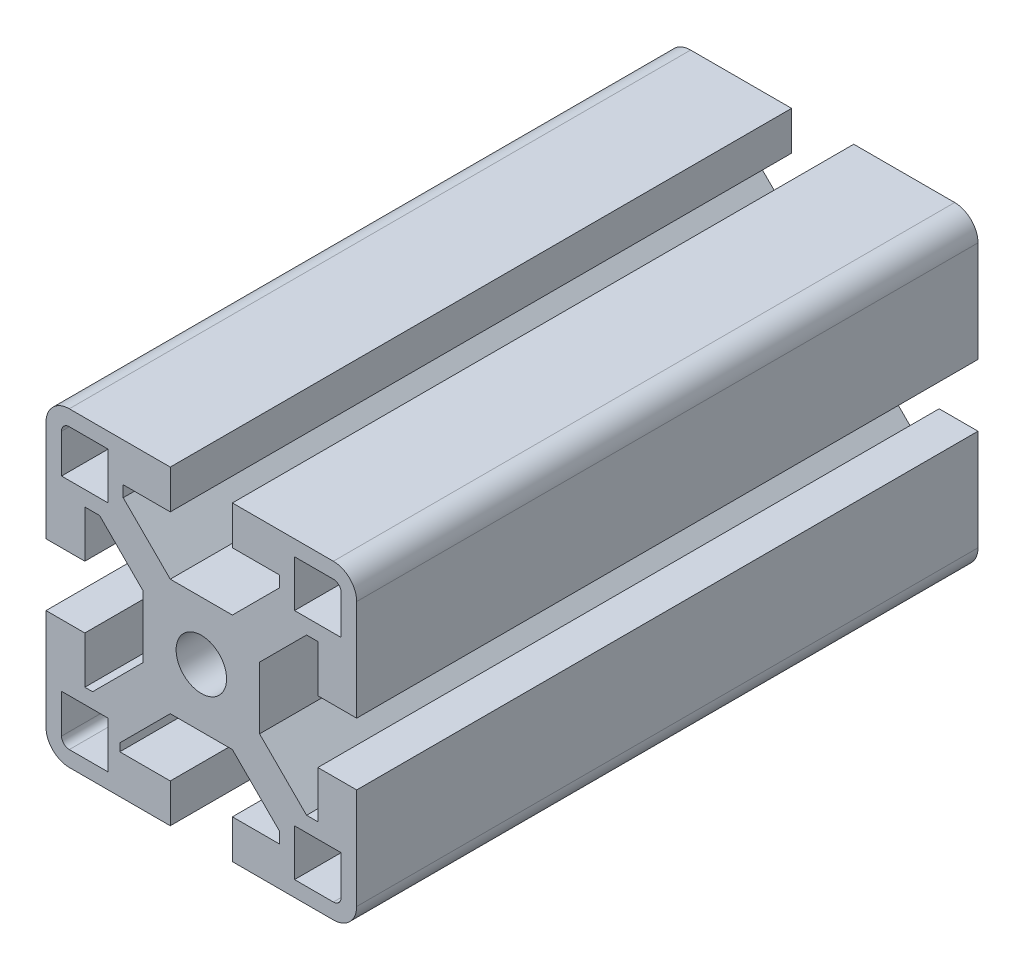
ISO-10303-21;
HEADER;
FILE_DESCRIPTION(('STEP AP214'),'2;1');
FILE_NAME('part.step','',(''),(''),'','','');
FILE_SCHEMA(('AUTOMOTIVE_DESIGN { 1 0 10303 214 1 1 1 1 }'));
ENDSEC;
DATA;
#1=APPLICATION_CONTEXT('core data for automotive mechanical design processes');
#2=APPLICATION_PROTOCOL_DEFINITION('international standard','automotive_design',2000,#1);
#3=PRODUCT_CONTEXT('',#1,'mechanical');
#4=PRODUCT('Part','Part','',(#3));
#5=PRODUCT_RELATED_PRODUCT_CATEGORY('part','',(#4));
#6=PRODUCT_DEFINITION_FORMATION('','',#4);
#7=PRODUCT_DEFINITION_CONTEXT('part definition',#1,'design');
#8=PRODUCT_DEFINITION('design','',#6,#7);
#9=PRODUCT_DEFINITION_SHAPE('','',#8);
#10=(LENGTH_UNIT() NAMED_UNIT(*) SI_UNIT(.MILLI.,.METRE.));
#11=(NAMED_UNIT(*) PLANE_ANGLE_UNIT() SI_UNIT($,.RADIAN.));
#12=(NAMED_UNIT(*) SI_UNIT($,.STERADIAN.) SOLID_ANGLE_UNIT());
#13=UNCERTAINTY_MEASURE_WITH_UNIT(LENGTH_MEASURE(1.E-05),#10,'distance_accuracy_value','');
#14=(GEOMETRIC_REPRESENTATION_CONTEXT(3) GLOBAL_UNCERTAINTY_ASSIGNED_CONTEXT((#13)) GLOBAL_UNIT_ASSIGNED_CONTEXT((#10,
#11,#12)) REPRESENTATION_CONTEXT('',''));
#15=CARTESIAN_POINT('',(0.,0.,0.));
#16=DIRECTION('',(0.,0.,1.));
#17=DIRECTION('',(1.,0.,0.));
#18=AXIS2_PLACEMENT_3D('',#15,#16,#17);
#19=CARTESIAN_POINT('',(-17.,17.,80.));
#20=DIRECTION('',(0.,0.,-1.));
#21=DIRECTION('',(-1.,0.,0.));
#22=AXIS2_PLACEMENT_3D('',#19,#20,#21);
#23=PLANE('',#22);
#24=DIRECTION('',(0.,1.,0.));
#25=VECTOR('',#24,1.);
#26=CARTESIAN_POINT('',(18.,-17.,80.));
#27=LINE('',#26,#25);
#28=CARTESIAN_POINT('',(18.,-17.,80.));
#29=VERTEX_POINT('',#28);
#30=CARTESIAN_POINT('',(18.,-12.,80.));
#31=VERTEX_POINT('',#30);
#32=EDGE_CURVE('E455',#29,#31,#27,.T.);
#33=ORIENTED_EDGE('',*,*,#32,.F.);
#34=CARTESIAN_POINT('',(17.,-17.,80.));
#35=DIRECTION('',(0.,0.,1.));
#36=DIRECTION('',(1.,0.,0.));
#37=AXIS2_PLACEMENT_3D('',#34,#35,#36);
#38=CIRCLE('',#37,1.);
#39=CARTESIAN_POINT('',(17.,-18.,80.));
#40=VERTEX_POINT('',#39);
#41=EDGE_CURVE('E484',#40,#29,#38,.T.);
#42=ORIENTED_EDGE('',*,*,#41,.F.);
#43=DIRECTION('',(1.,0.,0.));
#44=VECTOR('',#43,1.);
#45=CARTESIAN_POINT('',(17.,-18.,80.));
#46=LINE('',#45,#44);
#47=CARTESIAN_POINT('',(12.,-18.,80.));
#48=VERTEX_POINT('',#47);
#49=EDGE_CURVE('E479',#48,#40,#46,.T.);
#50=ORIENTED_EDGE('',*,*,#49,.F.);
#51=DIRECTION('',(0.,-1.,0.));
#52=VECTOR('',#51,1.);
#53=CARTESIAN_POINT('',(12.,-18.,80.));
#54=LINE('',#53,#52);
#55=CARTESIAN_POINT('',(12.,-12.,80.));
#56=VERTEX_POINT('',#55);
#57=EDGE_CURVE('E477',#56,#48,#54,.T.);
#58=ORIENTED_EDGE('',*,*,#57,.F.);
#59=DIRECTION('',(-1.,0.,0.));
#60=VECTOR('',#59,1.);
#61=CARTESIAN_POINT('',(18.,-12.,80.));
#62=LINE('',#61,#60);
#63=EDGE_CURVE('E463',#31,#56,#62,.T.);
#64=ORIENTED_EDGE('',*,*,#63,.F.);
#65=EDGE_LOOP('',(#33,#42,#50,#58,#64));
#66=FACE_BOUND('',#65,.T.);
#67=DIRECTION('',(0.,-1.,0.));
#68=VECTOR('',#67,1.);
#69=CARTESIAN_POINT('',(12.,12.,80.));
#70=LINE('',#69,#68);
#71=CARTESIAN_POINT('',(12.,18.,80.));
#72=VERTEX_POINT('',#71);
#73=CARTESIAN_POINT('',(12.,12.,80.));
#74=VERTEX_POINT('',#73);
#75=EDGE_CURVE('E540',#72,#74,#70,.T.);
#76=ORIENTED_EDGE('',*,*,#75,.F.);
#77=DIRECTION('',(-1.,0.,0.));
#78=VECTOR('',#77,1.);
#79=CARTESIAN_POINT('',(12.,18.,80.));
#80=LINE('',#79,#78);
#81=CARTESIAN_POINT('',(17.,18.,80.));
#82=VERTEX_POINT('',#81);
#83=EDGE_CURVE('E550',#82,#72,#80,.T.);
#84=ORIENTED_EDGE('',*,*,#83,.F.);
#85=CARTESIAN_POINT('',(17.,17.,80.));
#86=DIRECTION('',(0.,0.,1.));
#87=DIRECTION('',(1.,0.,0.));
#88=AXIS2_PLACEMENT_3D('',#85,#86,#87);
#89=CIRCLE('',#88,1.);
#90=CARTESIAN_POINT('',(18.,17.,80.));
#91=VERTEX_POINT('',#90);
#92=EDGE_CURVE('E547',#91,#82,#89,.T.);
#93=ORIENTED_EDGE('',*,*,#92,.F.);
#94=DIRECTION('',(0.,1.,0.));
#95=VECTOR('',#94,1.);
#96=CARTESIAN_POINT('',(18.,12.,80.));
#97=LINE('',#96,#95);
#98=CARTESIAN_POINT('',(18.,12.,80.));
#99=VERTEX_POINT('',#98);
#100=EDGE_CURVE('E545',#99,#91,#97,.T.);
#101=ORIENTED_EDGE('',*,*,#100,.F.);
#102=DIRECTION('',(1.,0.,0.));
#103=VECTOR('',#102,1.);
#104=CARTESIAN_POINT('',(12.,12.,80.));
#105=LINE('',#104,#103);
#106=EDGE_CURVE('E542',#74,#99,#105,.T.);
#107=ORIENTED_EDGE('',*,*,#106,.F.);
#108=EDGE_LOOP('',(#76,#84,#93,#101,#107));
#109=FACE_BOUND('',#108,.T.);
#110=CARTESIAN_POINT('',(-17.,17.,80.));
#111=DIRECTION('',(0.,0.,1.));
#112=DIRECTION('',(-1.,0.,0.));
#113=AXIS2_PLACEMENT_3D('',#110,#111,#112);
#114=CIRCLE('',#113,3.);
#115=CARTESIAN_POINT('',(-17.,20.,80.));
#116=VERTEX_POINT('',#115);
#117=CARTESIAN_POINT('',(-20.,17.,80.));
#118=VERTEX_POINT('',#117);
#119=EDGE_CURVE('E616',#116,#118,#114,.T.);
#120=ORIENTED_EDGE('',*,*,#119,.T.);
#121=DIRECTION('',(0.,-1.,0.));
#122=VECTOR('',#121,1.);
#123=CARTESIAN_POINT('',(-20.,3.99999999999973,80.));
#124=LINE('',#123,#122);
#125=CARTESIAN_POINT('',(-20.,3.99999999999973,80.));
#126=VERTEX_POINT('',#125);
#127=EDGE_CURVE('E619',#118,#126,#124,.T.);
#128=ORIENTED_EDGE('',*,*,#127,.T.);
#129=DIRECTION('',(1.,0.,0.));
#130=VECTOR('',#129,1.);
#131=CARTESIAN_POINT('',(-20.,3.99999999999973,80.));
#132=LINE('',#131,#130);
#133=CARTESIAN_POINT('',(-15.0000000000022,3.99999999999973,80.));
#134=VERTEX_POINT('',#133);
#135=EDGE_CURVE('E622',#126,#134,#132,.T.);
#136=ORIENTED_EDGE('',*,*,#135,.T.);
#137=DIRECTION('',(0.,1.,0.));
#138=VECTOR('',#137,1.);
#139=CARTESIAN_POINT('',(-15.0000000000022,3.99999999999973,80.));
#140=LINE('',#139,#138);
#141=CARTESIAN_POINT('',(-15.0000000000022,10.0499999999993,80.));
#142=VERTEX_POINT('',#141);
#143=EDGE_CURVE('E624',#134,#142,#140,.T.);
#144=ORIENTED_EDGE('',*,*,#143,.T.);
#145=DIRECTION('',(1.,0.,0.));
#146=VECTOR('',#145,1.);
#147=CARTESIAN_POINT('',(-15.0000000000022,10.0499999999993,80.));
#148=LINE('',#147,#146);
#149=CARTESIAN_POINT('',(-13.0999999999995,10.0499999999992,80.));
#150=VERTEX_POINT('',#149);
#151=EDGE_CURVE('E626',#142,#150,#148,.T.);
#152=ORIENTED_EDGE('',*,*,#151,.T.);
#153=DIRECTION('',(0.707106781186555,-0.70710678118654,0.));
#154=VECTOR('',#153,1.);
#155=CARTESIAN_POINT('',(-7.49999999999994,4.44999999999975,80.));
#156=LINE('',#155,#154);
#157=CARTESIAN_POINT('',(-7.49999999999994,4.44999999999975,80.));
#158=VERTEX_POINT('',#157);
#159=EDGE_CURVE('E628',#150,#158,#156,.T.);
#160=ORIENTED_EDGE('',*,*,#159,.T.);
#161=DIRECTION('',(0.,-1.,0.));
#162=VECTOR('',#161,1.);
#163=CARTESIAN_POINT('',(-7.49999999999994,-3.55000000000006,80.));
#164=LINE('',#163,#162);
#165=CARTESIAN_POINT('',(-7.49999999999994,-3.55000000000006,80.));
#166=VERTEX_POINT('',#165);
#167=EDGE_CURVE('E630',#158,#166,#164,.T.);
#168=ORIENTED_EDGE('',*,*,#167,.T.);
#169=DIRECTION('',(-0.70710678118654,-0.707106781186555,0.));
#170=VECTOR('',#169,1.);
#171=CARTESIAN_POINT('',(-7.49999999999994,-3.55000000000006,80.));
#172=LINE('',#171,#170);
#173=CARTESIAN_POINT('',(-13.9999999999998,-10.05,80.));
#174=VERTEX_POINT('',#173);
#175=EDGE_CURVE('E632',#166,#174,#172,.T.);
#176=ORIENTED_EDGE('',*,*,#175,.T.);
#177=DIRECTION('',(-1.,0.,0.));
#178=VECTOR('',#177,1.);
#179=CARTESIAN_POINT('',(-15.0000000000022,-10.05,80.));
#180=LINE('',#179,#178);
#181=CARTESIAN_POINT('',(-15.0000000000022,-10.05,80.));
#182=VERTEX_POINT('',#181);
#183=EDGE_CURVE('E634',#174,#182,#180,.T.);
#184=ORIENTED_EDGE('',*,*,#183,.T.);
#185=DIRECTION('',(0.,1.,0.));
#186=VECTOR('',#185,1.);
#187=CARTESIAN_POINT('',(-15.0000000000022,-10.05,80.));
#188=LINE('',#187,#186);
#189=CARTESIAN_POINT('',(-15.0000000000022,-4.00000000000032,80.));
#190=VERTEX_POINT('',#189);
#191=EDGE_CURVE('E636',#182,#190,#188,.T.);
#192=ORIENTED_EDGE('',*,*,#191,.T.);
#193=DIRECTION('',(-1.,0.,0.));
#194=VECTOR('',#193,1.);
#195=CARTESIAN_POINT('',(-20.,-4.00000000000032,80.));
#196=LINE('',#195,#194);
#197=CARTESIAN_POINT('',(-20.,-4.00000000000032,80.));
#198=VERTEX_POINT('',#197);
#199=EDGE_CURVE('E638',#190,#198,#196,.T.);
#200=ORIENTED_EDGE('',*,*,#199,.T.);
#201=DIRECTION('',(0.,-1.,0.));
#202=VECTOR('',#201,1.);
#203=CARTESIAN_POINT('',(-20.,-17.,80.));
#204=LINE('',#203,#202);
#205=CARTESIAN_POINT('',(-20.,-17.,80.));
#206=VERTEX_POINT('',#205);
#207=EDGE_CURVE('E640',#198,#206,#204,.T.);
#208=ORIENTED_EDGE('',*,*,#207,.T.);
#209=CARTESIAN_POINT('',(-17.,-17.,80.));
#210=DIRECTION('',(0.,0.,1.));
#211=DIRECTION('',(-1.,0.,0.));
#212=AXIS2_PLACEMENT_3D('',#209,#210,#211);
#213=CIRCLE('',#212,3.);
#214=CARTESIAN_POINT('',(-17.,-20.,80.));
#215=VERTEX_POINT('',#214);
#216=EDGE_CURVE('E642',#206,#215,#213,.T.);
#217=ORIENTED_EDGE('',*,*,#216,.T.);
#218=DIRECTION('',(1.,0.,0.));
#219=VECTOR('',#218,1.);
#220=CARTESIAN_POINT('',(-17.,-20.,80.));
#221=LINE('',#220,#219);
#222=CARTESIAN_POINT('',(-4.,-20.,80.));
#223=VERTEX_POINT('',#222);
#224=EDGE_CURVE('E644',#215,#223,#221,.T.);
#225=ORIENTED_EDGE('',*,*,#224,.T.);
#226=DIRECTION('',(0.,1.,0.));
#227=VECTOR('',#226,1.);
#228=CARTESIAN_POINT('',(-4.,-20.,80.));
#229=LINE('',#228,#227);
#230=CARTESIAN_POINT('',(-4.,-15.,80.));
#231=VERTEX_POINT('',#230);
#232=EDGE_CURVE('E646',#223,#231,#229,.T.);
#233=ORIENTED_EDGE('',*,*,#232,.T.);
#234=DIRECTION('',(-1.,0.,0.));
#235=VECTOR('',#234,1.);
#236=CARTESIAN_POINT('',(-10.4999999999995,-14.9999999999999,80.));
#237=LINE('',#236,#235);
#238=CARTESIAN_POINT('',(-10.4999999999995,-14.9999999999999,80.));
#239=VERTEX_POINT('',#238);
#240=EDGE_CURVE('E648',#231,#239,#237,.T.);
#241=ORIENTED_EDGE('',*,*,#240,.T.);
#242=DIRECTION('',(0.,1.,0.));
#243=VECTOR('',#242,1.);
#244=CARTESIAN_POINT('',(-10.4999999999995,-13.9999999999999,80.));
#245=LINE('',#244,#243);
#246=CARTESIAN_POINT('',(-10.4999999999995,-13.9999999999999,80.));
#247=VERTEX_POINT('',#246);
#248=EDGE_CURVE('E650',#239,#247,#245,.T.);
#249=ORIENTED_EDGE('',*,*,#248,.T.);
#250=DIRECTION('',(0.707106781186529,0.707106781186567,0.));
#251=VECTOR('',#250,1.);
#252=CARTESIAN_POINT('',(-10.4999999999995,-13.9999999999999,80.));
#253=LINE('',#252,#251);
#254=CARTESIAN_POINT('',(-4.,-7.5,80.));
#255=VERTEX_POINT('',#254);
#256=EDGE_CURVE('E652',#247,#255,#253,.T.);
#257=ORIENTED_EDGE('',*,*,#256,.T.);
#258=DIRECTION('',(1.,0.,0.));
#259=VECTOR('',#258,1.);
#260=CARTESIAN_POINT('',(-4.,-7.5,80.));
#261=LINE('',#260,#259);
#262=CARTESIAN_POINT('',(4.,-7.5,80.));
#263=VERTEX_POINT('',#262);
#264=EDGE_CURVE('E654',#255,#263,#261,.T.);
#265=ORIENTED_EDGE('',*,*,#264,.T.);
#266=DIRECTION('',(0.707106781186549,-0.707106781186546,0.));
#267=VECTOR('',#266,1.);
#268=CARTESIAN_POINT('',(4.,-7.5,80.));
#269=LINE('',#268,#267);
#270=CARTESIAN_POINT('',(10.0499999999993,-13.5499999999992,80.));
#271=VERTEX_POINT('',#270);
#272=EDGE_CURVE('E656',#263,#271,#269,.T.);
#273=ORIENTED_EDGE('',*,*,#272,.T.);
#274=DIRECTION('',(0.,-1.,0.));
#275=VECTOR('',#274,1.);
#276=CARTESIAN_POINT('',(10.0499999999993,-15.,80.));
#277=LINE('',#276,#275);
#278=CARTESIAN_POINT('',(10.0499999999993,-15.,80.));
#279=VERTEX_POINT('',#278);
#280=EDGE_CURVE('E658',#271,#279,#277,.T.);
#281=ORIENTED_EDGE('',*,*,#280,.T.);
#282=DIRECTION('',(-1.,0.,0.));
#283=VECTOR('',#282,1.);
#284=CARTESIAN_POINT('',(4.,-15.,80.));
#285=LINE('',#284,#283);
#286=CARTESIAN_POINT('',(4.,-15.,80.));
#287=VERTEX_POINT('',#286);
#288=EDGE_CURVE('E660',#279,#287,#285,.T.);
#289=ORIENTED_EDGE('',*,*,#288,.T.);
#290=DIRECTION('',(0.,-1.,0.));
#291=VECTOR('',#290,1.);
#292=CARTESIAN_POINT('',(4.,-20.,80.));
#293=LINE('',#292,#291);
#294=CARTESIAN_POINT('',(4.,-20.,80.));
#295=VERTEX_POINT('',#294);
#296=EDGE_CURVE('E662',#287,#295,#293,.T.);
#297=ORIENTED_EDGE('',*,*,#296,.T.);
#298=DIRECTION('',(1.,0.,0.));
#299=VECTOR('',#298,1.);
#300=CARTESIAN_POINT('',(17.,-20.,80.));
#301=LINE('',#300,#299);
#302=CARTESIAN_POINT('',(17.,-20.,80.));
#303=VERTEX_POINT('',#302);
#304=EDGE_CURVE('E664',#295,#303,#301,.T.);
#305=ORIENTED_EDGE('',*,*,#304,.T.);
#306=CARTESIAN_POINT('',(17.,-17.,80.));
#307=DIRECTION('',(0.,0.,1.));
#308=DIRECTION('',(1.,0.,0.));
#309=AXIS2_PLACEMENT_3D('',#306,#307,#308);
#310=CIRCLE('',#309,3.);
#311=CARTESIAN_POINT('',(20.,-17.,80.));
#312=VERTEX_POINT('',#311);
#313=EDGE_CURVE('E666',#303,#312,#310,.T.);
#314=ORIENTED_EDGE('',*,*,#313,.T.);
#315=DIRECTION('',(0.,1.,0.));
#316=VECTOR('',#315,1.);
#317=CARTESIAN_POINT('',(20.,-17.,80.));
#318=LINE('',#317,#316);
#319=CARTESIAN_POINT('',(20.,-4.00000000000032,80.));
#320=VERTEX_POINT('',#319);
#321=EDGE_CURVE('E668',#312,#320,#318,.T.);
#322=ORIENTED_EDGE('',*,*,#321,.T.);
#323=DIRECTION('',(-1.,0.,0.));
#324=VECTOR('',#323,1.);
#325=CARTESIAN_POINT('',(20.,-4.00000000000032,80.));
#326=LINE('',#325,#324);
#327=CARTESIAN_POINT('',(15.,-4.00000000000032,80.));
#328=VERTEX_POINT('',#327);
#329=EDGE_CURVE('E670',#320,#328,#326,.T.);
#330=ORIENTED_EDGE('',*,*,#329,.T.);
#331=DIRECTION('',(0.,-1.,0.));
#332=VECTOR('',#331,1.);
#333=CARTESIAN_POINT('',(15.,-10.05,80.));
#334=LINE('',#333,#332);
#335=CARTESIAN_POINT('',(15.,-10.05,80.));
#336=VERTEX_POINT('',#335);
#337=EDGE_CURVE('E672',#328,#336,#334,.T.);
#338=ORIENTED_EDGE('',*,*,#337,.T.);
#339=DIRECTION('',(-1.,0.,0.));
#340=VECTOR('',#339,1.);
#341=CARTESIAN_POINT('',(13.5499999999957,-10.05,80.));
#342=LINE('',#341,#340);
#343=CARTESIAN_POINT('',(13.5499999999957,-10.05,80.));
#344=VERTEX_POINT('',#343);
#345=EDGE_CURVE('E674',#336,#344,#342,.T.);
#346=ORIENTED_EDGE('',*,*,#345,.T.);
#347=DIRECTION('',(-0.707106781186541,0.707106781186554,0.));
#348=VECTOR('',#347,1.);
#349=CARTESIAN_POINT('',(7.4999999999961,-4.00000000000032,80.));
#350=LINE('',#349,#348);
#351=CARTESIAN_POINT('',(7.4999999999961,-4.00000000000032,80.));
#352=VERTEX_POINT('',#351);
#353=EDGE_CURVE('E676',#344,#352,#350,.T.);
#354=ORIENTED_EDGE('',*,*,#353,.T.);
#355=DIRECTION('',(0.,1.,0.));
#356=VECTOR('',#355,1.);
#357=CARTESIAN_POINT('',(7.4999999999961,-4.00000000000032,80.));
#358=LINE('',#357,#356);
#359=CARTESIAN_POINT('',(7.4999999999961,3.99999999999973,80.));
#360=VERTEX_POINT('',#359);
#361=EDGE_CURVE('E678',#352,#360,#358,.T.);
#362=ORIENTED_EDGE('',*,*,#361,.T.);
#363=DIRECTION('',(0.707106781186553,0.707106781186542,0.));
#364=VECTOR('',#363,1.);
#365=CARTESIAN_POINT('',(7.4999999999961,3.99999999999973,80.));
#366=LINE('',#365,#364);
#367=CARTESIAN_POINT('',(13.5499999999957,10.0499999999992,80.));
#368=VERTEX_POINT('',#367);
#369=EDGE_CURVE('E680',#360,#368,#366,.T.);
#370=ORIENTED_EDGE('',*,*,#369,.T.);
#371=DIRECTION('',(1.,-1.17243379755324E-13,0.));
#372=VECTOR('',#371,1.);
#373=CARTESIAN_POINT('',(13.5499999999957,10.0499999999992,80.));
#374=LINE('',#373,#372);
#375=CARTESIAN_POINT('',(15.,10.049999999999,80.));
#376=VERTEX_POINT('',#375);
#377=EDGE_CURVE('E682',#368,#376,#374,.T.);
#378=ORIENTED_EDGE('',*,*,#377,.T.);
#379=DIRECTION('',(0.,-1.,0.));
#380=VECTOR('',#379,1.);
#381=CARTESIAN_POINT('',(15.,3.99999999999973,80.));
#382=LINE('',#381,#380);
#383=CARTESIAN_POINT('',(15.,3.99999999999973,80.));
#384=VERTEX_POINT('',#383);
#385=EDGE_CURVE('E684',#376,#384,#382,.T.);
#386=ORIENTED_EDGE('',*,*,#385,.T.);
#387=DIRECTION('',(1.,0.,0.));
#388=VECTOR('',#387,1.);
#389=CARTESIAN_POINT('',(20.,3.99999999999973,80.));
#390=LINE('',#389,#388);
#391=CARTESIAN_POINT('',(20.,3.99999999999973,80.));
#392=VERTEX_POINT('',#391);
#393=EDGE_CURVE('E686',#384,#392,#390,.T.);
#394=ORIENTED_EDGE('',*,*,#393,.T.);
#395=DIRECTION('',(0.,1.,0.));
#396=VECTOR('',#395,1.);
#397=CARTESIAN_POINT('',(20.,3.99999999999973,80.));
#398=LINE('',#397,#396);
#399=CARTESIAN_POINT('',(20.,17.,80.));
#400=VERTEX_POINT('',#399);
#401=EDGE_CURVE('E688',#392,#400,#398,.T.);
#402=ORIENTED_EDGE('',*,*,#401,.T.);
#403=CARTESIAN_POINT('',(17.,17.,80.));
#404=DIRECTION('',(0.,0.,1.));
#405=DIRECTION('',(-1.,0.,0.));
#406=AXIS2_PLACEMENT_3D('',#403,#404,#405);
#407=CIRCLE('',#406,3.);
#408=CARTESIAN_POINT('',(17.,20.,80.));
#409=VERTEX_POINT('',#408);
#410=EDGE_CURVE('E690',#400,#409,#407,.T.);
#411=ORIENTED_EDGE('',*,*,#410,.T.);
#412=DIRECTION('',(-1.,0.,0.));
#413=VECTOR('',#412,1.);
#414=CARTESIAN_POINT('',(4.00000000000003,20.,80.));
#415=LINE('',#414,#413);
#416=CARTESIAN_POINT('',(4.00000000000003,20.,80.));
#417=VERTEX_POINT('',#416);
#418=EDGE_CURVE('E692',#409,#417,#415,.T.);
#419=ORIENTED_EDGE('',*,*,#418,.T.);
#420=DIRECTION('',(0.,-1.,0.));
#421=VECTOR('',#420,1.);
#422=CARTESIAN_POINT('',(4.00000000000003,20.,80.));
#423=LINE('',#422,#421);
#424=CARTESIAN_POINT('',(4.00000000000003,15.,80.));
#425=VERTEX_POINT('',#424);
#426=EDGE_CURVE('E694',#417,#425,#423,.T.);
#427=ORIENTED_EDGE('',*,*,#426,.T.);
#428=DIRECTION('',(1.,0.,0.));
#429=VECTOR('',#428,1.);
#430=CARTESIAN_POINT('',(4.00000000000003,15.,80.));
#431=LINE('',#430,#429);
#432=CARTESIAN_POINT('',(10.0499999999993,15.,80.));
#433=VERTEX_POINT('',#432);
#434=EDGE_CURVE('E696',#425,#433,#431,.T.);
#435=ORIENTED_EDGE('',*,*,#434,.T.);
#436=DIRECTION('',(0.,-1.,0.));
#437=VECTOR('',#436,1.);
#438=CARTESIAN_POINT('',(10.0499999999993,13.5499999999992,80.));
#439=LINE('',#438,#437);
#440=CARTESIAN_POINT('',(10.0499999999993,13.5499999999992,80.));
#441=VERTEX_POINT('',#440);
#442=EDGE_CURVE('E698',#433,#441,#439,.T.);
#443=ORIENTED_EDGE('',*,*,#442,.T.);
#444=DIRECTION('',(-0.707106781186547,-0.707106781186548,0.));
#445=VECTOR('',#444,1.);
#446=CARTESIAN_POINT('',(4.00000000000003,7.5,80.));
#447=LINE('',#446,#445);
#448=CARTESIAN_POINT('',(4.00000000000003,7.5,80.));
#449=VERTEX_POINT('',#448);
#450=EDGE_CURVE('E700',#441,#449,#447,.T.);
#451=ORIENTED_EDGE('',*,*,#450,.T.);
#452=DIRECTION('',(-1.,0.,0.));
#453=VECTOR('',#452,1.);
#454=CARTESIAN_POINT('',(-3.99999999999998,7.5,80.));
#455=LINE('',#454,#453);
#456=CARTESIAN_POINT('',(-3.99999999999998,7.5,80.));
#457=VERTEX_POINT('',#456);
#458=EDGE_CURVE('E702',#449,#457,#455,.T.);
#459=ORIENTED_EDGE('',*,*,#458,.T.);
#460=DIRECTION('',(-0.707857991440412,0.706354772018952,0.));
#461=VECTOR('',#460,1.);
#462=CARTESIAN_POINT('',(-10.0628752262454,13.5499999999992,80.));
#463=LINE('',#462,#461);
#464=CARTESIAN_POINT('',(-10.0628752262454,13.5499999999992,80.));
#465=VERTEX_POINT('',#464);
#466=EDGE_CURVE('E704',#457,#465,#463,.T.);
#467=ORIENTED_EDGE('',*,*,#466,.T.);
#468=DIRECTION('',(0.,1.,0.));
#469=VECTOR('',#468,1.);
#470=CARTESIAN_POINT('',(-10.0628752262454,13.5499999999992,80.));
#471=LINE('',#470,#469);
#472=CARTESIAN_POINT('',(-10.0628752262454,15.,80.));
#473=VERTEX_POINT('',#472);
#474=EDGE_CURVE('E706',#465,#473,#471,.T.);
#475=ORIENTED_EDGE('',*,*,#474,.T.);
#476=DIRECTION('',(1.,0.,0.));
#477=VECTOR('',#476,1.);
#478=CARTESIAN_POINT('',(-10.0628752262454,15.,80.));
#479=LINE('',#478,#477);
#480=CARTESIAN_POINT('',(-3.99999999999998,15.,80.));
#481=VERTEX_POINT('',#480);
#482=EDGE_CURVE('E708',#473,#481,#479,.T.);
#483=ORIENTED_EDGE('',*,*,#482,.T.);
#484=DIRECTION('',(0.,1.,0.));
#485=VECTOR('',#484,1.);
#486=CARTESIAN_POINT('',(-3.99999999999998,20.,80.));
#487=LINE('',#486,#485);
#488=CARTESIAN_POINT('',(-3.99999999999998,20.,80.));
#489=VERTEX_POINT('',#488);
#490=EDGE_CURVE('E710',#481,#489,#487,.T.);
#491=ORIENTED_EDGE('',*,*,#490,.T.);
#492=DIRECTION('',(-1.,0.,0.));
#493=VECTOR('',#492,1.);
#494=CARTESIAN_POINT('',(-17.,20.,80.));
#495=LINE('',#494,#493);
#496=EDGE_CURVE('E712',#489,#116,#495,.T.);
#497=ORIENTED_EDGE('',*,*,#496,.T.);
#498=EDGE_LOOP('',(#120,#128,#136,#144,#152,#160,#168,#176,#184,#192,#200,#208,#217,#225,#233,
#241,#249,#257,#265,#273,#281,#289,#297,#305,#314,#322,#330,#338,#346,#354,#362,#370,#378,#386,
#394,#402,#411,#419,#427,#435,#443,#451,#459,#467,#475,#483,#491,#497));
#499=FACE_BOUND('',#498,.T.);
#500=DIRECTION('',(0.,1.,0.));
#501=VECTOR('',#500,1.);
#502=CARTESIAN_POINT('',(-12.,12.,80.));
#503=LINE('',#502,#501);
#504=CARTESIAN_POINT('',(-12.,12.,80.));
#505=VERTEX_POINT('',#504);
#506=CARTESIAN_POINT('',(-12.,18.,80.));
#507=VERTEX_POINT('',#506);
#508=EDGE_CURVE('E578',#505,#507,#503,.T.);
#509=ORIENTED_EDGE('',*,*,#508,.F.);
#510=DIRECTION('',(1.,0.,0.));
#511=VECTOR('',#510,1.);
#512=CARTESIAN_POINT('',(-18.,12.,80.));
#513=LINE('',#512,#511);
#514=CARTESIAN_POINT('',(-18.,12.,80.));
#515=VERTEX_POINT('',#514);
#516=EDGE_CURVE('E588',#515,#505,#513,.T.);
#517=ORIENTED_EDGE('',*,*,#516,.F.);
#518=DIRECTION('',(0.,-1.,0.));
#519=VECTOR('',#518,1.);
#520=CARTESIAN_POINT('',(-18.,12.,80.));
#521=LINE('',#520,#519);
#522=CARTESIAN_POINT('',(-18.,17.,80.));
#523=VERTEX_POINT('',#522);
#524=EDGE_CURVE('E585',#523,#515,#521,.T.);
#525=ORIENTED_EDGE('',*,*,#524,.F.);
#526=CARTESIAN_POINT('',(-17.,17.,80.));
#527=DIRECTION('',(0.,0.,1.));
#528=DIRECTION('',(-1.,0.,0.));
#529=AXIS2_PLACEMENT_3D('',#526,#527,#528);
#530=CIRCLE('',#529,1.);
#531=CARTESIAN_POINT('',(-17.,18.,80.));
#532=VERTEX_POINT('',#531);
#533=EDGE_CURVE('E583',#532,#523,#530,.T.);
#534=ORIENTED_EDGE('',*,*,#533,.F.);
#535=DIRECTION('',(-1.,0.,0.));
#536=VECTOR('',#535,1.);
#537=CARTESIAN_POINT('',(-17.,18.,80.));
#538=LINE('',#537,#536);
#539=EDGE_CURVE('E580',#507,#532,#538,.T.);
#540=ORIENTED_EDGE('',*,*,#539,.F.);
#541=EDGE_LOOP('',(#509,#517,#525,#534,#540));
#542=FACE_BOUND('',#541,.T.);
#543=DIRECTION('',(0.,1.,0.));
#544=VECTOR('',#543,1.);
#545=CARTESIAN_POINT('',(-12.,-18.,80.));
#546=LINE('',#545,#544);
#547=CARTESIAN_POINT('',(-12.,-18.,80.));
#548=VERTEX_POINT('',#547);
#549=CARTESIAN_POINT('',(-12.,-12.,80.));
#550=VERTEX_POINT('',#549);
#551=EDGE_CURVE('E502',#548,#550,#546,.T.);
#552=ORIENTED_EDGE('',*,*,#551,.F.);
#553=DIRECTION('',(1.,0.,0.));
#554=VECTOR('',#553,1.);
#555=CARTESIAN_POINT('',(-17.,-18.,80.));
#556=LINE('',#555,#554);
#557=CARTESIAN_POINT('',(-17.,-18.,80.));
#558=VERTEX_POINT('',#557);
#559=EDGE_CURVE('E512',#558,#548,#556,.T.);
#560=ORIENTED_EDGE('',*,*,#559,.F.);
#561=CARTESIAN_POINT('',(-17.,-17.,80.));
#562=DIRECTION('',(0.,0.,1.));
#563=DIRECTION('',(1.,0.,0.));
#564=AXIS2_PLACEMENT_3D('',#561,#562,#563);
#565=CIRCLE('',#564,1.);
#566=CARTESIAN_POINT('',(-18.,-17.,80.));
#567=VERTEX_POINT('',#566);
#568=EDGE_CURVE('E509',#567,#558,#565,.T.);
#569=ORIENTED_EDGE('',*,*,#568,.F.);
#570=DIRECTION('',(0.,-1.,0.));
#571=VECTOR('',#570,1.);
#572=CARTESIAN_POINT('',(-18.,-17.,80.));
#573=LINE('',#572,#571);
#574=CARTESIAN_POINT('',(-18.,-12.,80.));
#575=VERTEX_POINT('',#574);
#576=EDGE_CURVE('E507',#575,#567,#573,.T.);
#577=ORIENTED_EDGE('',*,*,#576,.F.);
#578=DIRECTION('',(-1.,0.,0.));
#579=VECTOR('',#578,1.);
#580=CARTESIAN_POINT('',(-18.,-12.,80.));
#581=LINE('',#580,#579);
#582=EDGE_CURVE('E504',#550,#575,#581,.T.);
#583=ORIENTED_EDGE('',*,*,#582,.F.);
#584=EDGE_LOOP('',(#552,#560,#569,#577,#583));
#585=FACE_BOUND('',#584,.T.);
#586=CARTESIAN_POINT('',(0.,0.,80.));
#587=DIRECTION('',(0.,0.,1.));
#588=DIRECTION('',(1.,0.,0.));
#589=AXIS2_PLACEMENT_3D('',#586,#587,#588);
#590=CIRCLE('',#589,3.25);
#591=CARTESIAN_POINT('',(3.25,0.,80.));
#592=VERTEX_POINT('',#591);
#593=EDGE_CURVE('E487',#592,#592,#590,.T.);
#594=ORIENTED_EDGE('',*,*,#593,.F.);
#595=EDGE_LOOP('',(#594));
#596=FACE_BOUND('',#595,.T.);
#597=ADVANCED_FACE('F30',(#66,#109,#499,#542,#585,#596),#23,.F.);
#598=CARTESIAN_POINT('',(-17.,17.,0.));
#599=DIRECTION('',(0.,0.,-1.));
#600=DIRECTION('',(-1.,0.,0.));
#601=AXIS2_PLACEMENT_3D('',#598,#599,#600);
#602=PLANE('',#601);
#603=CARTESIAN_POINT('',(17.,-17.,0.));
#604=DIRECTION('',(0.,0.,1.));
#605=DIRECTION('',(1.,0.,0.));
#606=AXIS2_PLACEMENT_3D('',#603,#604,#605);
#607=CIRCLE('',#606,1.);
#608=CARTESIAN_POINT('',(17.,-18.,0.));
#609=VERTEX_POINT('',#608);
#610=CARTESIAN_POINT('',(18.,-17.,0.));
#611=VERTEX_POINT('',#610);
#612=EDGE_CURVE('E464',#609,#611,#607,.T.);
#613=ORIENTED_EDGE('',*,*,#612,.T.);
#614=DIRECTION('',(0.,1.,0.));
#615=VECTOR('',#614,1.);
#616=CARTESIAN_POINT('',(18.,-17.,0.));
#617=LINE('',#616,#615);
#618=CARTESIAN_POINT('',(18.,-12.,0.));
#619=VERTEX_POINT('',#618);
#620=EDGE_CURVE('E53',#611,#619,#617,.T.);
#621=ORIENTED_EDGE('',*,*,#620,.T.);
#622=DIRECTION('',(-1.,0.,0.));
#623=VECTOR('',#622,1.);
#624=CARTESIAN_POINT('',(18.,-12.,0.));
#625=LINE('',#624,#623);
#626=CARTESIAN_POINT('',(12.,-12.,0.));
#627=VERTEX_POINT('',#626);
#628=EDGE_CURVE('E470',#619,#627,#625,.T.);
#629=ORIENTED_EDGE('',*,*,#628,.T.);
#630=DIRECTION('',(0.,-1.,0.));
#631=VECTOR('',#630,1.);
#632=CARTESIAN_POINT('',(12.,-18.,0.));
#633=LINE('',#632,#631);
#634=CARTESIAN_POINT('',(12.,-18.,0.));
#635=VERTEX_POINT('',#634);
#636=EDGE_CURVE('E489',#627,#635,#633,.T.);
#637=ORIENTED_EDGE('',*,*,#636,.T.);
#638=DIRECTION('',(1.,0.,0.));
#639=VECTOR('',#638,1.);
#640=CARTESIAN_POINT('',(17.,-18.,0.));
#641=LINE('',#640,#639);
#642=EDGE_CURVE('E492',#635,#609,#641,.T.);
#643=ORIENTED_EDGE('',*,*,#642,.T.);
#644=EDGE_LOOP('',(#613,#621,#629,#637,#643));
#645=FACE_BOUND('',#644,.T.);
#646=DIRECTION('',(-1.,0.,0.));
#647=VECTOR('',#646,1.);
#648=CARTESIAN_POINT('',(12.,18.,0.));
#649=LINE('',#648,#647);
#650=CARTESIAN_POINT('',(17.,18.,0.));
#651=VERTEX_POINT('',#650);
#652=CARTESIAN_POINT('',(12.,18.,0.));
#653=VERTEX_POINT('',#652);
#654=EDGE_CURVE('E543',#651,#653,#649,.T.);
#655=ORIENTED_EDGE('',*,*,#654,.T.);
#656=DIRECTION('',(0.,-1.,0.));
#657=VECTOR('',#656,1.);
#658=CARTESIAN_POINT('',(12.,12.,0.));
#659=LINE('',#658,#657);
#660=CARTESIAN_POINT('',(12.,12.,0.));
#661=VERTEX_POINT('',#660);
#662=EDGE_CURVE('E539',#653,#661,#659,.T.);
#663=ORIENTED_EDGE('',*,*,#662,.T.);
#664=DIRECTION('',(1.,0.,0.));
#665=VECTOR('',#664,1.);
#666=CARTESIAN_POINT('',(12.,12.,0.));
#667=LINE('',#666,#665);
#668=CARTESIAN_POINT('',(18.,12.,0.));
#669=VERTEX_POINT('',#668);
#670=EDGE_CURVE('E555',#661,#669,#667,.T.);
#671=ORIENTED_EDGE('',*,*,#670,.T.);
#672=DIRECTION('',(0.,1.,0.));
#673=VECTOR('',#672,1.);
#674=CARTESIAN_POINT('',(18.,12.,0.));
#675=LINE('',#674,#673);
#676=CARTESIAN_POINT('',(18.,17.,0.));
#677=VERTEX_POINT('',#676);
#678=EDGE_CURVE('E558',#669,#677,#675,.T.);
#679=ORIENTED_EDGE('',*,*,#678,.T.);
#680=CARTESIAN_POINT('',(17.,17.,0.));
#681=DIRECTION('',(0.,0.,1.));
#682=DIRECTION('',(1.,0.,0.));
#683=AXIS2_PLACEMENT_3D('',#680,#681,#682);
#684=CIRCLE('',#683,1.);
#685=EDGE_CURVE('E561',#677,#651,#684,.T.);
#686=ORIENTED_EDGE('',*,*,#685,.T.);
#687=EDGE_LOOP('',(#655,#663,#671,#679,#686));
#688=FACE_BOUND('',#687,.T.);
#689=CARTESIAN_POINT('',(-17.,17.,0.));
#690=DIRECTION('',(0.,0.,1.));
#691=DIRECTION('',(-1.,0.,0.));
#692=AXIS2_PLACEMENT_3D('',#689,#690,#691);
#693=CIRCLE('',#692,3.);
#694=CARTESIAN_POINT('',(-17.,20.,0.));
#695=VERTEX_POINT('',#694);
#696=CARTESIAN_POINT('',(-20.,17.,0.));
#697=VERTEX_POINT('',#696);
#698=EDGE_CURVE('E615',#695,#697,#693,.T.);
#699=ORIENTED_EDGE('',*,*,#698,.F.);
#700=DIRECTION('',(-1.,0.,0.));
#701=VECTOR('',#700,1.);
#702=CARTESIAN_POINT('',(-17.,20.,0.));
#703=LINE('',#702,#701);
#704=CARTESIAN_POINT('',(-3.99999999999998,20.,0.));
#705=VERTEX_POINT('',#704);
#706=EDGE_CURVE('E620',#705,#695,#703,.T.);
#707=ORIENTED_EDGE('',*,*,#706,.F.);
#708=DIRECTION('',(0.,1.,0.));
#709=VECTOR('',#708,1.);
#710=CARTESIAN_POINT('',(-3.99999999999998,20.,0.));
#711=LINE('',#710,#709);
#712=CARTESIAN_POINT('',(-3.99999999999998,15.,0.));
#713=VERTEX_POINT('',#712);
#714=EDGE_CURVE('E807',#713,#705,#711,.T.);
#715=ORIENTED_EDGE('',*,*,#714,.F.);
#716=DIRECTION('',(1.,0.,0.));
#717=VECTOR('',#716,1.);
#718=CARTESIAN_POINT('',(-10.0628752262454,15.,0.));
#719=LINE('',#718,#717);
#720=CARTESIAN_POINT('',(-10.0628752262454,15.,0.));
#721=VERTEX_POINT('',#720);
#722=EDGE_CURVE('E805',#721,#713,#719,.T.);
#723=ORIENTED_EDGE('',*,*,#722,.F.);
#724=DIRECTION('',(0.,1.,0.));
#725=VECTOR('',#724,1.);
#726=CARTESIAN_POINT('',(-10.0628752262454,13.5499999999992,0.));
#727=LINE('',#726,#725);
#728=CARTESIAN_POINT('',(-10.0628752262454,13.5499999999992,0.));
#729=VERTEX_POINT('',#728);
#730=EDGE_CURVE('E803',#729,#721,#727,.T.);
#731=ORIENTED_EDGE('',*,*,#730,.F.);
#732=DIRECTION('',(-0.707857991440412,0.706354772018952,0.));
#733=VECTOR('',#732,1.);
#734=CARTESIAN_POINT('',(-10.0628752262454,13.5499999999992,0.));
#735=LINE('',#734,#733);
#736=CARTESIAN_POINT('',(-3.99999999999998,7.5,0.));
#737=VERTEX_POINT('',#736);
#738=EDGE_CURVE('E801',#737,#729,#735,.T.);
#739=ORIENTED_EDGE('',*,*,#738,.F.);
#740=DIRECTION('',(-1.,0.,0.));
#741=VECTOR('',#740,1.);
#742=CARTESIAN_POINT('',(-3.99999999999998,7.5,0.));
#743=LINE('',#742,#741);
#744=CARTESIAN_POINT('',(4.00000000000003,7.5,0.));
#745=VERTEX_POINT('',#744);
#746=EDGE_CURVE('E799',#745,#737,#743,.T.);
#747=ORIENTED_EDGE('',*,*,#746,.F.);
#748=DIRECTION('',(-0.707106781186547,-0.707106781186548,0.));
#749=VECTOR('',#748,1.);
#750=CARTESIAN_POINT('',(4.00000000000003,7.5,0.));
#751=LINE('',#750,#749);
#752=CARTESIAN_POINT('',(10.0499999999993,13.5499999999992,0.));
#753=VERTEX_POINT('',#752);
#754=EDGE_CURVE('E797',#753,#745,#751,.T.);
#755=ORIENTED_EDGE('',*,*,#754,.F.);
#756=DIRECTION('',(0.,-1.,0.));
#757=VECTOR('',#756,1.);
#758=CARTESIAN_POINT('',(10.0499999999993,13.5499999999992,0.));
#759=LINE('',#758,#757);
#760=CARTESIAN_POINT('',(10.0499999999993,15.,0.));
#761=VERTEX_POINT('',#760);
#762=EDGE_CURVE('E795',#761,#753,#759,.T.);
#763=ORIENTED_EDGE('',*,*,#762,.F.);
#764=DIRECTION('',(1.,0.,0.));
#765=VECTOR('',#764,1.);
#766=CARTESIAN_POINT('',(4.00000000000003,15.,0.));
#767=LINE('',#766,#765);
#768=CARTESIAN_POINT('',(4.00000000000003,15.,0.));
#769=VERTEX_POINT('',#768);
#770=EDGE_CURVE('E793',#769,#761,#767,.T.);
#771=ORIENTED_EDGE('',*,*,#770,.F.);
#772=DIRECTION('',(0.,-1.,0.));
#773=VECTOR('',#772,1.);
#774=CARTESIAN_POINT('',(4.00000000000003,20.,0.));
#775=LINE('',#774,#773);
#776=CARTESIAN_POINT('',(4.00000000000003,20.,0.));
#777=VERTEX_POINT('',#776);
#778=EDGE_CURVE('E791',#777,#769,#775,.T.);
#779=ORIENTED_EDGE('',*,*,#778,.F.);
#780=DIRECTION('',(-1.,0.,0.));
#781=VECTOR('',#780,1.);
#782=CARTESIAN_POINT('',(4.00000000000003,20.,0.));
#783=LINE('',#782,#781);
#784=CARTESIAN_POINT('',(17.,20.,0.));
#785=VERTEX_POINT('',#784);
#786=EDGE_CURVE('E789',#785,#777,#783,.T.);
#787=ORIENTED_EDGE('',*,*,#786,.F.);
#788=CARTESIAN_POINT('',(17.,17.,0.));
#789=DIRECTION('',(0.,0.,1.));
#790=DIRECTION('',(-1.,0.,0.));
#791=AXIS2_PLACEMENT_3D('',#788,#789,#790);
#792=CIRCLE('',#791,3.);
#793=CARTESIAN_POINT('',(20.,17.,0.));
#794=VERTEX_POINT('',#793);
#795=EDGE_CURVE('E787',#794,#785,#792,.T.);
#796=ORIENTED_EDGE('',*,*,#795,.F.);
#797=DIRECTION('',(0.,1.,0.));
#798=VECTOR('',#797,1.);
#799=CARTESIAN_POINT('',(20.,3.99999999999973,0.));
#800=LINE('',#799,#798);
#801=CARTESIAN_POINT('',(20.,3.99999999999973,0.));
#802=VERTEX_POINT('',#801);
#803=EDGE_CURVE('E785',#802,#794,#800,.T.);
#804=ORIENTED_EDGE('',*,*,#803,.F.);
#805=DIRECTION('',(1.,0.,0.));
#806=VECTOR('',#805,1.);
#807=CARTESIAN_POINT('',(20.,3.99999999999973,0.));
#808=LINE('',#807,#806);
#809=CARTESIAN_POINT('',(15.,3.99999999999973,0.));
#810=VERTEX_POINT('',#809);
#811=EDGE_CURVE('E783',#810,#802,#808,.T.);
#812=ORIENTED_EDGE('',*,*,#811,.F.);
#813=DIRECTION('',(0.,-1.,0.));
#814=VECTOR('',#813,1.);
#815=CARTESIAN_POINT('',(15.,3.99999999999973,0.));
#816=LINE('',#815,#814);
#817=CARTESIAN_POINT('',(15.,10.049999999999,0.));
#818=VERTEX_POINT('',#817);
#819=EDGE_CURVE('E781',#818,#810,#816,.T.);
#820=ORIENTED_EDGE('',*,*,#819,.F.);
#821=DIRECTION('',(1.,-1.17243379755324E-13,0.));
#822=VECTOR('',#821,1.);
#823=CARTESIAN_POINT('',(13.5499999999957,10.0499999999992,0.));
#824=LINE('',#823,#822);
#825=CARTESIAN_POINT('',(13.5499999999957,10.0499999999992,0.));
#826=VERTEX_POINT('',#825);
#827=EDGE_CURVE('E779',#826,#818,#824,.T.);
#828=ORIENTED_EDGE('',*,*,#827,.F.);
#829=DIRECTION('',(0.707106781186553,0.707106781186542,0.));
#830=VECTOR('',#829,1.);
#831=CARTESIAN_POINT('',(7.4999999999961,3.99999999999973,0.));
#832=LINE('',#831,#830);
#833=CARTESIAN_POINT('',(7.4999999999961,3.99999999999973,0.));
#834=VERTEX_POINT('',#833);
#835=EDGE_CURVE('E777',#834,#826,#832,.T.);
#836=ORIENTED_EDGE('',*,*,#835,.F.);
#837=DIRECTION('',(0.,1.,0.));
#838=VECTOR('',#837,1.);
#839=CARTESIAN_POINT('',(7.4999999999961,-4.00000000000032,0.));
#840=LINE('',#839,#838);
#841=CARTESIAN_POINT('',(7.4999999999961,-4.00000000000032,0.));
#842=VERTEX_POINT('',#841);
#843=EDGE_CURVE('E775',#842,#834,#840,.T.);
#844=ORIENTED_EDGE('',*,*,#843,.F.);
#845=DIRECTION('',(-0.707106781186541,0.707106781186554,0.));
#846=VECTOR('',#845,1.);
#847=CARTESIAN_POINT('',(7.4999999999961,-4.00000000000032,0.));
#848=LINE('',#847,#846);
#849=CARTESIAN_POINT('',(13.5499999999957,-10.05,0.));
#850=VERTEX_POINT('',#849);
#851=EDGE_CURVE('E773',#850,#842,#848,.T.);
#852=ORIENTED_EDGE('',*,*,#851,.F.);
#853=DIRECTION('',(-1.,0.,0.));
#854=VECTOR('',#853,1.);
#855=CARTESIAN_POINT('',(13.5499999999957,-10.05,0.));
#856=LINE('',#855,#854);
#857=CARTESIAN_POINT('',(15.,-10.05,0.));
#858=VERTEX_POINT('',#857);
#859=EDGE_CURVE('E771',#858,#850,#856,.T.);
#860=ORIENTED_EDGE('',*,*,#859,.F.);
#861=DIRECTION('',(0.,-1.,0.));
#862=VECTOR('',#861,1.);
#863=CARTESIAN_POINT('',(15.,-10.05,0.));
#864=LINE('',#863,#862);
#865=CARTESIAN_POINT('',(15.,-4.00000000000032,0.));
#866=VERTEX_POINT('',#865);
#867=EDGE_CURVE('E769',#866,#858,#864,.T.);
#868=ORIENTED_EDGE('',*,*,#867,.F.);
#869=DIRECTION('',(-1.,0.,0.));
#870=VECTOR('',#869,1.);
#871=CARTESIAN_POINT('',(20.,-4.00000000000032,0.));
#872=LINE('',#871,#870);
#873=CARTESIAN_POINT('',(20.,-4.00000000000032,0.));
#874=VERTEX_POINT('',#873);
#875=EDGE_CURVE('E767',#874,#866,#872,.T.);
#876=ORIENTED_EDGE('',*,*,#875,.F.);
#877=DIRECTION('',(0.,1.,0.));
#878=VECTOR('',#877,1.);
#879=CARTESIAN_POINT('',(20.,-17.,0.));
#880=LINE('',#879,#878);
#881=CARTESIAN_POINT('',(20.,-17.,0.));
#882=VERTEX_POINT('',#881);
#883=EDGE_CURVE('E765',#882,#874,#880,.T.);
#884=ORIENTED_EDGE('',*,*,#883,.F.);
#885=CARTESIAN_POINT('',(17.,-17.,0.));
#886=DIRECTION('',(0.,0.,1.));
#887=DIRECTION('',(1.,0.,0.));
#888=AXIS2_PLACEMENT_3D('',#885,#886,#887);
#889=CIRCLE('',#888,3.);
#890=CARTESIAN_POINT('',(17.,-20.,0.));
#891=VERTEX_POINT('',#890);
#892=EDGE_CURVE('E763',#891,#882,#889,.T.);
#893=ORIENTED_EDGE('',*,*,#892,.F.);
#894=DIRECTION('',(1.,0.,0.));
#895=VECTOR('',#894,1.);
#896=CARTESIAN_POINT('',(17.,-20.,0.));
#897=LINE('',#896,#895);
#898=CARTESIAN_POINT('',(4.,-20.,0.));
#899=VERTEX_POINT('',#898);
#900=EDGE_CURVE('E761',#899,#891,#897,.T.);
#901=ORIENTED_EDGE('',*,*,#900,.F.);
#902=DIRECTION('',(0.,-1.,0.));
#903=VECTOR('',#902,1.);
#904=CARTESIAN_POINT('',(4.,-20.,0.));
#905=LINE('',#904,#903);
#906=CARTESIAN_POINT('',(4.,-15.,0.));
#907=VERTEX_POINT('',#906);
#908=EDGE_CURVE('E759',#907,#899,#905,.T.);
#909=ORIENTED_EDGE('',*,*,#908,.F.);
#910=DIRECTION('',(-1.,0.,0.));
#911=VECTOR('',#910,1.);
#912=CARTESIAN_POINT('',(4.,-15.,0.));
#913=LINE('',#912,#911);
#914=CARTESIAN_POINT('',(10.0499999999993,-15.,0.));
#915=VERTEX_POINT('',#914);
#916=EDGE_CURVE('E757',#915,#907,#913,.T.);
#917=ORIENTED_EDGE('',*,*,#916,.F.);
#918=DIRECTION('',(0.,-1.,0.));
#919=VECTOR('',#918,1.);
#920=CARTESIAN_POINT('',(10.0499999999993,-15.,0.));
#921=LINE('',#920,#919);
#922=CARTESIAN_POINT('',(10.0499999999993,-13.5499999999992,0.));
#923=VERTEX_POINT('',#922);
#924=EDGE_CURVE('E755',#923,#915,#921,.T.);
#925=ORIENTED_EDGE('',*,*,#924,.F.);
#926=DIRECTION('',(0.707106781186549,-0.707106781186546,0.));
#927=VECTOR('',#926,1.);
#928=CARTESIAN_POINT('',(4.,-7.5,0.));
#929=LINE('',#928,#927);
#930=CARTESIAN_POINT('',(4.,-7.5,0.));
#931=VERTEX_POINT('',#930);
#932=EDGE_CURVE('E753',#931,#923,#929,.T.);
#933=ORIENTED_EDGE('',*,*,#932,.F.);
#934=DIRECTION('',(1.,0.,0.));
#935=VECTOR('',#934,1.);
#936=CARTESIAN_POINT('',(-4.,-7.5,0.));
#937=LINE('',#936,#935);
#938=CARTESIAN_POINT('',(-4.,-7.5,0.));
#939=VERTEX_POINT('',#938);
#940=EDGE_CURVE('E751',#939,#931,#937,.T.);
#941=ORIENTED_EDGE('',*,*,#940,.F.);
#942=DIRECTION('',(0.707106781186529,0.707106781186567,0.));
#943=VECTOR('',#942,1.);
#944=CARTESIAN_POINT('',(-10.4999999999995,-13.9999999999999,0.));
#945=LINE('',#944,#943);
#946=CARTESIAN_POINT('',(-10.4999999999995,-13.9999999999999,0.));
#947=VERTEX_POINT('',#946);
#948=EDGE_CURVE('E749',#947,#939,#945,.T.);
#949=ORIENTED_EDGE('',*,*,#948,.F.);
#950=DIRECTION('',(0.,1.,0.));
#951=VECTOR('',#950,1.);
#952=CARTESIAN_POINT('',(-10.4999999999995,-13.9999999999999,0.));
#953=LINE('',#952,#951);
#954=CARTESIAN_POINT('',(-10.4999999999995,-14.9999999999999,0.));
#955=VERTEX_POINT('',#954);
#956=EDGE_CURVE('E747',#955,#947,#953,.T.);
#957=ORIENTED_EDGE('',*,*,#956,.F.);
#958=DIRECTION('',(-1.,0.,0.));
#959=VECTOR('',#958,1.);
#960=CARTESIAN_POINT('',(-10.4999999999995,-14.9999999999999,0.));
#961=LINE('',#960,#959);
#962=CARTESIAN_POINT('',(-4.,-15.,0.));
#963=VERTEX_POINT('',#962);
#964=EDGE_CURVE('E745',#963,#955,#961,.T.);
#965=ORIENTED_EDGE('',*,*,#964,.F.);
#966=DIRECTION('',(0.,1.,0.));
#967=VECTOR('',#966,1.);
#968=CARTESIAN_POINT('',(-4.,-20.,0.));
#969=LINE('',#968,#967);
#970=CARTESIAN_POINT('',(-4.,-20.,0.));
#971=VERTEX_POINT('',#970);
#972=EDGE_CURVE('E743',#971,#963,#969,.T.);
#973=ORIENTED_EDGE('',*,*,#972,.F.);
#974=DIRECTION('',(1.,0.,0.));
#975=VECTOR('',#974,1.);
#976=CARTESIAN_POINT('',(-17.,-20.,0.));
#977=LINE('',#976,#975);
#978=CARTESIAN_POINT('',(-17.,-20.,0.));
#979=VERTEX_POINT('',#978);
#980=EDGE_CURVE('E741',#979,#971,#977,.T.);
#981=ORIENTED_EDGE('',*,*,#980,.F.);
#982=CARTESIAN_POINT('',(-17.,-17.,0.));
#983=DIRECTION('',(0.,0.,1.));
#984=DIRECTION('',(-1.,0.,0.));
#985=AXIS2_PLACEMENT_3D('',#982,#983,#984);
#986=CIRCLE('',#985,3.);
#987=CARTESIAN_POINT('',(-20.,-17.,0.));
#988=VERTEX_POINT('',#987);
#989=EDGE_CURVE('E739',#988,#979,#986,.T.);
#990=ORIENTED_EDGE('',*,*,#989,.F.);
#991=DIRECTION('',(0.,-1.,0.));
#992=VECTOR('',#991,1.);
#993=CARTESIAN_POINT('',(-20.,-17.,0.));
#994=LINE('',#993,#992);
#995=CARTESIAN_POINT('',(-20.,-4.00000000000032,0.));
#996=VERTEX_POINT('',#995);
#997=EDGE_CURVE('E737',#996,#988,#994,.T.);
#998=ORIENTED_EDGE('',*,*,#997,.F.);
#999=DIRECTION('',(-1.,0.,0.));
#1000=VECTOR('',#999,1.);
#1001=CARTESIAN_POINT('',(-20.,-4.00000000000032,0.));
#1002=LINE('',#1001,#1000);
#1003=CARTESIAN_POINT('',(-15.0000000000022,-4.00000000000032,0.));
#1004=VERTEX_POINT('',#1003);
#1005=EDGE_CURVE('E735',#1004,#996,#1002,.T.);
#1006=ORIENTED_EDGE('',*,*,#1005,.F.);
#1007=DIRECTION('',(0.,1.,0.));
#1008=VECTOR('',#1007,1.);
#1009=CARTESIAN_POINT('',(-15.0000000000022,-10.05,0.));
#1010=LINE('',#1009,#1008);
#1011=CARTESIAN_POINT('',(-15.0000000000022,-10.05,0.));
#1012=VERTEX_POINT('',#1011);
#1013=EDGE_CURVE('E733',#1012,#1004,#1010,.T.);
#1014=ORIENTED_EDGE('',*,*,#1013,.F.);
#1015=DIRECTION('',(-1.,0.,0.));
#1016=VECTOR('',#1015,1.);
#1017=CARTESIAN_POINT('',(-15.0000000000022,-10.05,0.));
#1018=LINE('',#1017,#1016);
#1019=CARTESIAN_POINT('',(-13.9999999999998,-10.05,0.));
#1020=VERTEX_POINT('',#1019);
#1021=EDGE_CURVE('E731',#1020,#1012,#1018,.T.);
#1022=ORIENTED_EDGE('',*,*,#1021,.F.);
#1023=DIRECTION('',(-0.70710678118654,-0.707106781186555,0.));
#1024=VECTOR('',#1023,1.);
#1025=CARTESIAN_POINT('',(-7.49999999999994,-3.55000000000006,0.));
#1026=LINE('',#1025,#1024);
#1027=CARTESIAN_POINT('',(-7.49999999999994,-3.55000000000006,0.));
#1028=VERTEX_POINT('',#1027);
#1029=EDGE_CURVE('E729',#1028,#1020,#1026,.T.);
#1030=ORIENTED_EDGE('',*,*,#1029,.F.);
#1031=DIRECTION('',(0.,-1.,0.));
#1032=VECTOR('',#1031,1.);
#1033=CARTESIAN_POINT('',(-7.49999999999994,-3.55000000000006,0.));
#1034=LINE('',#1033,#1032);
#1035=CARTESIAN_POINT('',(-7.49999999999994,4.44999999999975,0.));
#1036=VERTEX_POINT('',#1035);
#1037=EDGE_CURVE('E727',#1036,#1028,#1034,.T.);
#1038=ORIENTED_EDGE('',*,*,#1037,.F.);
#1039=DIRECTION('',(0.707106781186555,-0.70710678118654,0.));
#1040=VECTOR('',#1039,1.);
#1041=CARTESIAN_POINT('',(-7.49999999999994,4.44999999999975,0.));
#1042=LINE('',#1041,#1040);
#1043=CARTESIAN_POINT('',(-13.0999999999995,10.0499999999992,0.));
#1044=VERTEX_POINT('',#1043);
#1045=EDGE_CURVE('E725',#1044,#1036,#1042,.T.);
#1046=ORIENTED_EDGE('',*,*,#1045,.F.);
#1047=DIRECTION('',(1.,0.,0.));
#1048=VECTOR('',#1047,1.);
#1049=CARTESIAN_POINT('',(-15.0000000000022,10.0499999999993,0.));
#1050=LINE('',#1049,#1048);
#1051=CARTESIAN_POINT('',(-15.0000000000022,10.0499999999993,0.));
#1052=VERTEX_POINT('',#1051);
#1053=EDGE_CURVE('E723',#1052,#1044,#1050,.T.);
#1054=ORIENTED_EDGE('',*,*,#1053,.F.);
#1055=DIRECTION('',(0.,1.,0.));
#1056=VECTOR('',#1055,1.);
#1057=CARTESIAN_POINT('',(-15.0000000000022,3.99999999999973,0.));
#1058=LINE('',#1057,#1056);
#1059=CARTESIAN_POINT('',(-15.0000000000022,3.99999999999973,0.));
#1060=VERTEX_POINT('',#1059);
#1061=EDGE_CURVE('E721',#1060,#1052,#1058,.T.);
#1062=ORIENTED_EDGE('',*,*,#1061,.F.);
#1063=DIRECTION('',(1.,0.,0.));
#1064=VECTOR('',#1063,1.);
#1065=CARTESIAN_POINT('',(-20.,3.99999999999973,0.));
#1066=LINE('',#1065,#1064);
#1067=CARTESIAN_POINT('',(-20.,3.99999999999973,0.));
#1068=VERTEX_POINT('',#1067);
#1069=EDGE_CURVE('E719',#1068,#1060,#1066,.T.);
#1070=ORIENTED_EDGE('',*,*,#1069,.F.);
#1071=DIRECTION('',(0.,-1.,0.));
#1072=VECTOR('',#1071,1.);
#1073=CARTESIAN_POINT('',(-20.,3.99999999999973,0.));
#1074=LINE('',#1073,#1072);
#1075=EDGE_CURVE('E717',#697,#1068,#1074,.T.);
#1076=ORIENTED_EDGE('',*,*,#1075,.F.);
#1077=EDGE_LOOP('',(#699,#707,#715,#723,#731,#739,#747,#755,#763,#771,#779,#787,#796,#804,#812,
#820,#828,#836,#844,#852,#860,#868,#876,#884,#893,#901,#909,#917,#925,#933,#941,#949,#957,#965,
#973,#981,#990,#998,#1006,#1014,#1022,#1030,#1038,#1046,#1054,#1062,#1070,#1076));
#1078=FACE_BOUND('',#1077,.T.);
#1079=DIRECTION('',(1.,0.,0.));
#1080=VECTOR('',#1079,1.);
#1081=CARTESIAN_POINT('',(-18.,12.,0.));
#1082=LINE('',#1081,#1080);
#1083=CARTESIAN_POINT('',(-18.,12.,0.));
#1084=VERTEX_POINT('',#1083);
#1085=CARTESIAN_POINT('',(-12.,12.,0.));
#1086=VERTEX_POINT('',#1085);
#1087=EDGE_CURVE('E581',#1084,#1086,#1082,.T.);
#1088=ORIENTED_EDGE('',*,*,#1087,.T.);
#1089=DIRECTION('',(0.,1.,0.));
#1090=VECTOR('',#1089,1.);
#1091=CARTESIAN_POINT('',(-12.,12.,0.));
#1092=LINE('',#1091,#1090);
#1093=CARTESIAN_POINT('',(-12.,18.,0.));
#1094=VERTEX_POINT('',#1093);
#1095=EDGE_CURVE('E577',#1086,#1094,#1092,.T.);
#1096=ORIENTED_EDGE('',*,*,#1095,.T.);
#1097=DIRECTION('',(-1.,0.,0.));
#1098=VECTOR('',#1097,1.);
#1099=CARTESIAN_POINT('',(-17.,18.,0.));
#1100=LINE('',#1099,#1098);
#1101=CARTESIAN_POINT('',(-17.,18.,0.));
#1102=VERTEX_POINT('',#1101);
#1103=EDGE_CURVE('E593',#1094,#1102,#1100,.T.);
#1104=ORIENTED_EDGE('',*,*,#1103,.T.);
#1105=CARTESIAN_POINT('',(-17.,17.,0.));
#1106=DIRECTION('',(0.,0.,1.));
#1107=DIRECTION('',(-1.,0.,0.));
#1108=AXIS2_PLACEMENT_3D('',#1105,#1106,#1107);
#1109=CIRCLE('',#1108,1.);
#1110=CARTESIAN_POINT('',(-18.,17.,0.));
#1111=VERTEX_POINT('',#1110);
#1112=EDGE_CURVE('E596',#1102,#1111,#1109,.T.);
#1113=ORIENTED_EDGE('',*,*,#1112,.T.);
#1114=DIRECTION('',(0.,-1.,0.));
#1115=VECTOR('',#1114,1.);
#1116=CARTESIAN_POINT('',(-18.,12.,0.));
#1117=LINE('',#1116,#1115);
#1118=EDGE_CURVE('E599',#1111,#1084,#1117,.T.);
#1119=ORIENTED_EDGE('',*,*,#1118,.T.);
#1120=EDGE_LOOP('',(#1088,#1096,#1104,#1113,#1119));
#1121=FACE_BOUND('',#1120,.T.);
#1122=DIRECTION('',(1.,0.,0.));
#1123=VECTOR('',#1122,1.);
#1124=CARTESIAN_POINT('',(-17.,-18.,0.));
#1125=LINE('',#1124,#1123);
#1126=CARTESIAN_POINT('',(-17.,-18.,0.));
#1127=VERTEX_POINT('',#1126);
#1128=CARTESIAN_POINT('',(-12.,-18.,0.));
#1129=VERTEX_POINT('',#1128);
#1130=EDGE_CURVE('E505',#1127,#1129,#1125,.T.);
#1131=ORIENTED_EDGE('',*,*,#1130,.T.);
#1132=DIRECTION('',(0.,1.,0.));
#1133=VECTOR('',#1132,1.);
#1134=CARTESIAN_POINT('',(-12.,-18.,0.));
#1135=LINE('',#1134,#1133);
#1136=CARTESIAN_POINT('',(-12.,-12.,0.));
#1137=VERTEX_POINT('',#1136);
#1138=EDGE_CURVE('E471',#1129,#1137,#1135,.T.);
#1139=ORIENTED_EDGE('',*,*,#1138,.T.);
#1140=DIRECTION('',(-1.,0.,0.));
#1141=VECTOR('',#1140,1.);
#1142=CARTESIAN_POINT('',(-18.,-12.,0.));
#1143=LINE('',#1142,#1141);
#1144=CARTESIAN_POINT('',(-18.,-12.,0.));
#1145=VERTEX_POINT('',#1144);
#1146=EDGE_CURVE('E517',#1137,#1145,#1143,.T.);
#1147=ORIENTED_EDGE('',*,*,#1146,.T.);
#1148=DIRECTION('',(0.,-1.,0.));
#1149=VECTOR('',#1148,1.);
#1150=CARTESIAN_POINT('',(-18.,-17.,0.));
#1151=LINE('',#1150,#1149);
#1152=CARTESIAN_POINT('',(-18.,-17.,0.));
#1153=VERTEX_POINT('',#1152);
#1154=EDGE_CURVE('E520',#1145,#1153,#1151,.T.);
#1155=ORIENTED_EDGE('',*,*,#1154,.T.);
#1156=CARTESIAN_POINT('',(-17.,-17.,0.));
#1157=DIRECTION('',(0.,0.,1.));
#1158=DIRECTION('',(1.,0.,0.));
#1159=AXIS2_PLACEMENT_3D('',#1156,#1157,#1158);
#1160=CIRCLE('',#1159,1.);
#1161=EDGE_CURVE('E523',#1153,#1127,#1160,.T.);
#1162=ORIENTED_EDGE('',*,*,#1161,.T.);
#1163=EDGE_LOOP('',(#1131,#1139,#1147,#1155,#1162));
#1164=FACE_BOUND('',#1163,.T.);
#1165=CARTESIAN_POINT('',(0.,0.,0.));
#1166=DIRECTION('',(0.,0.,1.));
#1167=DIRECTION('',(1.,0.,0.));
#1168=AXIS2_PLACEMENT_3D('',#1165,#1166,#1167);
#1169=CIRCLE('',#1168,3.25);
#1170=CARTESIAN_POINT('',(3.25,0.,0.));
#1171=VERTEX_POINT('',#1170);
#1172=EDGE_CURVE('E1798',#1171,#1171,#1169,.T.);
#1173=ORIENTED_EDGE('',*,*,#1172,.T.);
#1174=EDGE_LOOP('',(#1173));
#1175=FACE_BOUND('',#1174,.T.);
#1176=ADVANCED_FACE('F957',(#645,#688,#1078,#1121,#1164,#1175),#602,.T.);
#1177=CARTESIAN_POINT('',(-17.,17.,80.));
#1178=DIRECTION('',(0.,0.,-1.));
#1179=DIRECTION('',(-1.,0.,0.));
#1180=AXIS2_PLACEMENT_3D('',#1177,#1178,#1179);
#1181=CYLINDRICAL_SURFACE('',#1180,3.);
#1182=ORIENTED_EDGE('',*,*,#698,.T.);
#1183=DIRECTION('',(0.,0.,-1.));
#1184=VECTOR('',#1183,1.);
#1185=CARTESIAN_POINT('',(-20.,17.,80.));
#1186=LINE('',#1185,#1184);
#1187=EDGE_CURVE('E11',#118,#697,#1186,.T.);
#1188=ORIENTED_EDGE('',*,*,#1187,.F.);
#1189=ORIENTED_EDGE('',*,*,#119,.F.);
#1190=DIRECTION('',(0.,0.,-1.));
#1191=VECTOR('',#1190,1.);
#1192=CARTESIAN_POINT('',(-17.,20.,80.));
#1193=LINE('',#1192,#1191);
#1194=EDGE_CURVE('E714',#116,#695,#1193,.T.);
#1195=ORIENTED_EDGE('',*,*,#1194,.T.);
#1196=EDGE_LOOP('',(#1182,#1188,#1189,#1195));
#1197=FACE_BOUND('',#1196,.T.);
#1198=ADVANCED_FACE('F32',(#1197),#1181,.T.);
#1199=CARTESIAN_POINT('',(-20.,3.99999999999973,80.));
#1200=DIRECTION('',(1.,0.,0.));
#1201=DIRECTION('',(0.,0.,-1.));
#1202=AXIS2_PLACEMENT_3D('',#1199,#1200,#1201);
#1203=PLANE('',#1202);
#1204=ORIENTED_EDGE('',*,*,#1075,.T.);
#1205=DIRECTION('',(0.,0.,-1.));
#1206=VECTOR('',#1205,1.);
#1207=CARTESIAN_POINT('',(-20.,3.99999999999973,80.));
#1208=LINE('',#1207,#1206);
#1209=EDGE_CURVE('E38',#126,#1068,#1208,.T.);
#1210=ORIENTED_EDGE('',*,*,#1209,.F.);
#1211=ORIENTED_EDGE('',*,*,#127,.F.);
#1212=ORIENTED_EDGE('',*,*,#1187,.T.);
#1213=EDGE_LOOP('',(#1204,#1210,#1211,#1212));
#1214=FACE_BOUND('',#1213,.T.);
#1215=ADVANCED_FACE('F975',(#1214),#1203,.F.);
#1216=CARTESIAN_POINT('',(-20.,3.99999999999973,80.));
#1217=DIRECTION('',(0.,1.,0.));
#1218=DIRECTION('',(0.,0.,1.));
#1219=AXIS2_PLACEMENT_3D('',#1216,#1217,#1218);
#1220=PLANE('',#1219);
#1221=ORIENTED_EDGE('',*,*,#1069,.T.);
#1222=DIRECTION('',(0.,0.,-1.));
#1223=VECTOR('',#1222,1.);
#1224=CARTESIAN_POINT('',(-15.0000000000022,3.99999999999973,80.));
#1225=LINE('',#1224,#1223);
#1226=EDGE_CURVE('E944',#134,#1060,#1225,.T.);
#1227=ORIENTED_EDGE('',*,*,#1226,.F.);
#1228=ORIENTED_EDGE('',*,*,#135,.F.);
#1229=ORIENTED_EDGE('',*,*,#1209,.T.);
#1230=EDGE_LOOP('',(#1221,#1227,#1228,#1229));
#1231=FACE_BOUND('',#1230,.T.);
#1232=ADVANCED_FACE('F951',(#1231),#1220,.F.);
#1233=CARTESIAN_POINT('',(-15.0000000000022,3.99999999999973,80.));
#1234=DIRECTION('',(-1.,0.,0.));
#1235=DIRECTION('',(0.,0.,1.));
#1236=AXIS2_PLACEMENT_3D('',#1233,#1234,#1235);
#1237=PLANE('',#1236);
#1238=ORIENTED_EDGE('',*,*,#1061,.T.);
#1239=DIRECTION('',(0.,0.,-1.));
#1240=VECTOR('',#1239,1.);
#1241=CARTESIAN_POINT('',(-15.0000000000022,10.0499999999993,80.));
#1242=LINE('',#1241,#1240);
#1243=EDGE_CURVE('E941',#142,#1052,#1242,.T.);
#1244=ORIENTED_EDGE('',*,*,#1243,.F.);
#1245=ORIENTED_EDGE('',*,*,#143,.F.);
#1246=ORIENTED_EDGE('',*,*,#1226,.T.);
#1247=EDGE_LOOP('',(#1238,#1244,#1245,#1246));
#1248=FACE_BOUND('',#1247,.T.);
#1249=ADVANCED_FACE('F963',(#1248),#1237,.F.);
#1250=CARTESIAN_POINT('',(-15.0000000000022,10.0499999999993,80.));
#1251=DIRECTION('',(0.,1.,0.));
#1252=DIRECTION('',(-1.,0.,0.));
#1253=AXIS2_PLACEMENT_3D('',#1250,#1251,#1252);
#1254=PLANE('',#1253);
#1255=ORIENTED_EDGE('',*,*,#1053,.T.);
#1256=DIRECTION('',(0.,0.,-1.));
#1257=VECTOR('',#1256,1.);
#1258=CARTESIAN_POINT('',(-13.0999999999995,10.0499999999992,80.));
#1259=LINE('',#1258,#1257);
#1260=EDGE_CURVE('E938',#150,#1044,#1259,.T.);
#1261=ORIENTED_EDGE('',*,*,#1260,.F.);
#1262=ORIENTED_EDGE('',*,*,#151,.F.);
#1263=ORIENTED_EDGE('',*,*,#1243,.T.);
#1264=EDGE_LOOP('',(#1255,#1261,#1262,#1263));
#1265=FACE_BOUND('',#1264,.T.);
#1266=ADVANCED_FACE('F967',(#1265),#1254,.F.);
#1267=CARTESIAN_POINT('',(-7.49999999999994,4.44999999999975,80.));
#1268=DIRECTION('',(0.70710678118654,0.707106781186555,0.));
#1269=DIRECTION('',(-0.707106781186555,0.70710678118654,0.));
#1270=AXIS2_PLACEMENT_3D('',#1267,#1268,#1269);
#1271=PLANE('',#1270);
#1272=ORIENTED_EDGE('',*,*,#1045,.T.);
#1273=DIRECTION('',(0.,0.,-1.));
#1274=VECTOR('',#1273,1.);
#1275=CARTESIAN_POINT('',(-7.49999999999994,4.44999999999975,80.));
#1276=LINE('',#1275,#1274);
#1277=EDGE_CURVE('E935',#158,#1036,#1276,.T.);
#1278=ORIENTED_EDGE('',*,*,#1277,.F.);
#1279=ORIENTED_EDGE('',*,*,#159,.F.);
#1280=ORIENTED_EDGE('',*,*,#1260,.T.);
#1281=EDGE_LOOP('',(#1272,#1278,#1279,#1280));
#1282=FACE_BOUND('',#1281,.T.);
#1283=ADVANCED_FACE('F1188',(#1282),#1271,.F.);
#1284=CARTESIAN_POINT('',(-7.49999999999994,-3.55000000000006,80.));
#1285=DIRECTION('',(1.,0.,0.));
#1286=DIRECTION('',(0.,1.,0.));
#1287=AXIS2_PLACEMENT_3D('',#1284,#1285,#1286);
#1288=PLANE('',#1287);
#1289=ORIENTED_EDGE('',*,*,#1037,.T.);
#1290=DIRECTION('',(0.,0.,-1.));
#1291=VECTOR('',#1290,1.);
#1292=CARTESIAN_POINT('',(-7.49999999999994,-3.55000000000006,80.));
#1293=LINE('',#1292,#1291);
#1294=EDGE_CURVE('E932',#166,#1028,#1293,.T.);
#1295=ORIENTED_EDGE('',*,*,#1294,.F.);
#1296=ORIENTED_EDGE('',*,*,#167,.F.);
#1297=ORIENTED_EDGE('',*,*,#1277,.T.);
#1298=EDGE_LOOP('',(#1289,#1295,#1296,#1297));
#1299=FACE_BOUND('',#1298,.T.);
#1300=ADVANCED_FACE('F1186',(#1299),#1288,.F.);
#1301=CARTESIAN_POINT('',(-7.49999999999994,-3.55000000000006,80.));
#1302=DIRECTION('',(0.707106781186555,-0.70710678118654,0.));
#1303=DIRECTION('',(0.70710678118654,0.707106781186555,0.));
#1304=AXIS2_PLACEMENT_3D('',#1301,#1302,#1303);
#1305=PLANE('',#1304);
#1306=ORIENTED_EDGE('',*,*,#1029,.T.);
#1307=DIRECTION('',(0.,0.,-1.));
#1308=VECTOR('',#1307,1.);
#1309=CARTESIAN_POINT('',(-13.9999999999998,-10.05,80.));
#1310=LINE('',#1309,#1308);
#1311=EDGE_CURVE('E929',#174,#1020,#1310,.T.);
#1312=ORIENTED_EDGE('',*,*,#1311,.F.);
#1313=ORIENTED_EDGE('',*,*,#175,.F.);
#1314=ORIENTED_EDGE('',*,*,#1294,.T.);
#1315=EDGE_LOOP('',(#1306,#1312,#1313,#1314));
#1316=FACE_BOUND('',#1315,.T.);
#1317=ADVANCED_FACE('F1182',(#1316),#1305,.F.);
#1318=CARTESIAN_POINT('',(-15.0000000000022,-10.05,80.));
#1319=DIRECTION('',(0.,-1.,0.));
#1320=DIRECTION('',(0.,0.,-1.));
#1321=AXIS2_PLACEMENT_3D('',#1318,#1319,#1320);
#1322=PLANE('',#1321);
#1323=ORIENTED_EDGE('',*,*,#1021,.T.);
#1324=DIRECTION('',(0.,0.,-1.));
#1325=VECTOR('',#1324,1.);
#1326=CARTESIAN_POINT('',(-15.0000000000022,-10.05,80.));
#1327=LINE('',#1326,#1325);
#1328=EDGE_CURVE('E926',#182,#1012,#1327,.T.);
#1329=ORIENTED_EDGE('',*,*,#1328,.F.);
#1330=ORIENTED_EDGE('',*,*,#183,.F.);
#1331=ORIENTED_EDGE('',*,*,#1311,.T.);
#1332=EDGE_LOOP('',(#1323,#1329,#1330,#1331));
#1333=FACE_BOUND('',#1332,.T.);
#1334=ADVANCED_FACE('F1177',(#1333),#1322,.F.);
#1335=CARTESIAN_POINT('',(-15.0000000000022,-10.05,80.));
#1336=DIRECTION('',(-1.,0.,0.));
#1337=DIRECTION('',(0.,0.,1.));
#1338=AXIS2_PLACEMENT_3D('',#1335,#1336,#1337);
#1339=PLANE('',#1338);
#1340=ORIENTED_EDGE('',*,*,#1013,.T.);
#1341=DIRECTION('',(0.,0.,-1.));
#1342=VECTOR('',#1341,1.);
#1343=CARTESIAN_POINT('',(-15.0000000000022,-4.00000000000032,80.));
#1344=LINE('',#1343,#1342);
#1345=EDGE_CURVE('E923',#190,#1004,#1344,.T.);
#1346=ORIENTED_EDGE('',*,*,#1345,.F.);
#1347=ORIENTED_EDGE('',*,*,#191,.F.);
#1348=ORIENTED_EDGE('',*,*,#1328,.T.);
#1349=EDGE_LOOP('',(#1340,#1346,#1347,#1348));
#1350=FACE_BOUND('',#1349,.T.);
#1351=ADVANCED_FACE('F1171',(#1350),#1339,.F.);
#1352=CARTESIAN_POINT('',(-20.,-4.00000000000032,80.));
#1353=DIRECTION('',(0.,-1.,0.));
#1354=DIRECTION('',(0.,0.,-1.));
#1355=AXIS2_PLACEMENT_3D('',#1352,#1353,#1354);
#1356=PLANE('',#1355);
#1357=ORIENTED_EDGE('',*,*,#1005,.T.);
#1358=DIRECTION('',(0.,0.,-1.));
#1359=VECTOR('',#1358,1.);
#1360=CARTESIAN_POINT('',(-20.,-4.00000000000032,80.));
#1361=LINE('',#1360,#1359);
#1362=EDGE_CURVE('E920',#198,#996,#1361,.T.);
#1363=ORIENTED_EDGE('',*,*,#1362,.F.);
#1364=ORIENTED_EDGE('',*,*,#199,.F.);
#1365=ORIENTED_EDGE('',*,*,#1345,.T.);
#1366=EDGE_LOOP('',(#1357,#1363,#1364,#1365));
#1367=FACE_BOUND('',#1366,.T.);
#1368=ADVANCED_FACE('F1167',(#1367),#1356,.F.);
#1369=CARTESIAN_POINT('',(-20.,-17.,80.));
#1370=DIRECTION('',(1.,0.,0.));
#1371=DIRECTION('',(0.,0.,-1.));
#1372=AXIS2_PLACEMENT_3D('',#1369,#1370,#1371);
#1373=PLANE('',#1372);
#1374=ORIENTED_EDGE('',*,*,#997,.T.);
#1375=DIRECTION('',(0.,0.,-1.));
#1376=VECTOR('',#1375,1.);
#1377=CARTESIAN_POINT('',(-20.,-17.,80.));
#1378=LINE('',#1377,#1376);
#1379=EDGE_CURVE('E917',#206,#988,#1378,.T.);
#1380=ORIENTED_EDGE('',*,*,#1379,.F.);
#1381=ORIENTED_EDGE('',*,*,#207,.F.);
#1382=ORIENTED_EDGE('',*,*,#1362,.T.);
#1383=EDGE_LOOP('',(#1374,#1380,#1381,#1382));
#1384=FACE_BOUND('',#1383,.T.);
#1385=ADVANCED_FACE('F1162',(#1384),#1373,.F.);
#1386=CARTESIAN_POINT('',(-17.,-17.,80.));
#1387=DIRECTION('',(0.,0.,-1.));
#1388=DIRECTION('',(-1.,0.,0.));
#1389=AXIS2_PLACEMENT_3D('',#1386,#1387,#1388);
#1390=CYLINDRICAL_SURFACE('',#1389,3.);
#1391=ORIENTED_EDGE('',*,*,#989,.T.);
#1392=DIRECTION('',(0.,0.,-1.));
#1393=VECTOR('',#1392,1.);
#1394=CARTESIAN_POINT('',(-17.,-20.,80.));
#1395=LINE('',#1394,#1393);
#1396=EDGE_CURVE('E914',#215,#979,#1395,.T.);
#1397=ORIENTED_EDGE('',*,*,#1396,.F.);
#1398=ORIENTED_EDGE('',*,*,#216,.F.);
#1399=ORIENTED_EDGE('',*,*,#1379,.T.);
#1400=EDGE_LOOP('',(#1391,#1397,#1398,#1399));
#1401=FACE_BOUND('',#1400,.T.);
#1402=ADVANCED_FACE('F1156',(#1401),#1390,.T.);
#1403=CARTESIAN_POINT('',(-17.,-20.,80.));
#1404=DIRECTION('',(0.,1.,0.));
#1405=DIRECTION('',(0.,0.,1.));
#1406=AXIS2_PLACEMENT_3D('',#1403,#1404,#1405);
#1407=PLANE('',#1406);
#1408=ORIENTED_EDGE('',*,*,#980,.T.);
#1409=DIRECTION('',(0.,0.,-1.));
#1410=VECTOR('',#1409,1.);
#1411=CARTESIAN_POINT('',(-4.,-20.,80.));
#1412=LINE('',#1411,#1410);
#1413=EDGE_CURVE('E911',#223,#971,#1412,.T.);
#1414=ORIENTED_EDGE('',*,*,#1413,.F.);
#1415=ORIENTED_EDGE('',*,*,#224,.F.);
#1416=ORIENTED_EDGE('',*,*,#1396,.T.);
#1417=EDGE_LOOP('',(#1408,#1414,#1415,#1416));
#1418=FACE_BOUND('',#1417,.T.);
#1419=ADVANCED_FACE('F1152',(#1418),#1407,.F.);
#1420=CARTESIAN_POINT('',(-4.,-20.,80.));
#1421=DIRECTION('',(-1.,0.,0.));
#1422=DIRECTION('',(0.,0.,1.));
#1423=AXIS2_PLACEMENT_3D('',#1420,#1421,#1422);
#1424=PLANE('',#1423);
#1425=ORIENTED_EDGE('',*,*,#972,.T.);
#1426=DIRECTION('',(0.,0.,-1.));
#1427=VECTOR('',#1426,1.);
#1428=CARTESIAN_POINT('',(-4.,-15.,80.));
#1429=LINE('',#1428,#1427);
#1430=EDGE_CURVE('E908',#231,#963,#1429,.T.);
#1431=ORIENTED_EDGE('',*,*,#1430,.F.);
#1432=ORIENTED_EDGE('',*,*,#232,.F.);
#1433=ORIENTED_EDGE('',*,*,#1413,.T.);
#1434=EDGE_LOOP('',(#1425,#1431,#1432,#1433));
#1435=FACE_BOUND('',#1434,.T.);
#1436=ADVANCED_FACE('F1147',(#1435),#1424,.F.);
#1437=CARTESIAN_POINT('',(-10.4999999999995,-14.9999999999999,80.));
#1438=DIRECTION('',(0.,-1.,0.));
#1439=DIRECTION('',(1.,0.,0.));
#1440=AXIS2_PLACEMENT_3D('',#1437,#1438,#1439);
#1441=PLANE('',#1440);
#1442=ORIENTED_EDGE('',*,*,#964,.T.);
#1443=DIRECTION('',(0.,0.,-1.));
#1444=VECTOR('',#1443,1.);
#1445=CARTESIAN_POINT('',(-10.4999999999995,-14.9999999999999,80.));
#1446=LINE('',#1445,#1444);
#1447=EDGE_CURVE('E905',#239,#955,#1446,.T.);
#1448=ORIENTED_EDGE('',*,*,#1447,.F.);
#1449=ORIENTED_EDGE('',*,*,#240,.F.);
#1450=ORIENTED_EDGE('',*,*,#1430,.T.);
#1451=EDGE_LOOP('',(#1442,#1448,#1449,#1450));
#1452=FACE_BOUND('',#1451,.T.);
#1453=ADVANCED_FACE('F1141',(#1452),#1441,.F.);
#1454=CARTESIAN_POINT('',(-10.4999999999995,-13.9999999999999,80.));
#1455=DIRECTION('',(-1.,0.,0.));
#1456=DIRECTION('',(0.,0.,1.));
#1457=AXIS2_PLACEMENT_3D('',#1454,#1455,#1456);
#1458=PLANE('',#1457);
#1459=ORIENTED_EDGE('',*,*,#956,.T.);
#1460=DIRECTION('',(0.,0.,-1.));
#1461=VECTOR('',#1460,1.);
#1462=CARTESIAN_POINT('',(-10.4999999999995,-13.9999999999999,80.));
#1463=LINE('',#1462,#1461);
#1464=EDGE_CURVE('E902',#247,#947,#1463,.T.);
#1465=ORIENTED_EDGE('',*,*,#1464,.F.);
#1466=ORIENTED_EDGE('',*,*,#248,.F.);
#1467=ORIENTED_EDGE('',*,*,#1447,.T.);
#1468=EDGE_LOOP('',(#1459,#1465,#1466,#1467));
#1469=FACE_BOUND('',#1468,.T.);
#1470=ADVANCED_FACE('F1137',(#1469),#1458,.F.);
#1471=CARTESIAN_POINT('',(-10.4999999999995,-13.9999999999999,80.));
#1472=DIRECTION('',(-0.707106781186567,0.707106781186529,0.));
#1473=DIRECTION('',(-0.707106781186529,-0.707106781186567,0.));
#1474=AXIS2_PLACEMENT_3D('',#1471,#1472,#1473);
#1475=PLANE('',#1474);
#1476=ORIENTED_EDGE('',*,*,#948,.T.);
#1477=DIRECTION('',(0.,0.,-1.));
#1478=VECTOR('',#1477,1.);
#1479=CARTESIAN_POINT('',(-4.,-7.5,80.));
#1480=LINE('',#1479,#1478);
#1481=EDGE_CURVE('E899',#255,#939,#1480,.T.);
#1482=ORIENTED_EDGE('',*,*,#1481,.F.);
#1483=ORIENTED_EDGE('',*,*,#256,.F.);
#1484=ORIENTED_EDGE('',*,*,#1464,.T.);
#1485=EDGE_LOOP('',(#1476,#1482,#1483,#1484));
#1486=FACE_BOUND('',#1485,.T.);
#1487=ADVANCED_FACE('F1132',(#1486),#1475,.F.);
#1488=CARTESIAN_POINT('',(-4.,-7.5,80.));
#1489=DIRECTION('',(0.,1.,0.));
#1490=DIRECTION('',(0.,0.,1.));
#1491=AXIS2_PLACEMENT_3D('',#1488,#1489,#1490);
#1492=PLANE('',#1491);
#1493=ORIENTED_EDGE('',*,*,#940,.T.);
#1494=DIRECTION('',(0.,0.,-1.));
#1495=VECTOR('',#1494,1.);
#1496=CARTESIAN_POINT('',(4.,-7.5,80.));
#1497=LINE('',#1496,#1495);
#1498=EDGE_CURVE('E896',#263,#931,#1497,.T.);
#1499=ORIENTED_EDGE('',*,*,#1498,.F.);
#1500=ORIENTED_EDGE('',*,*,#264,.F.);
#1501=ORIENTED_EDGE('',*,*,#1481,.T.);
#1502=EDGE_LOOP('',(#1493,#1499,#1500,#1501));
#1503=FACE_BOUND('',#1502,.T.);
#1504=ADVANCED_FACE('F1126',(#1503),#1492,.F.);
#1505=CARTESIAN_POINT('',(4.,-7.5,80.));
#1506=DIRECTION('',(0.707106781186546,0.707106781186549,0.));
#1507=DIRECTION('',(-0.707106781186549,0.707106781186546,0.));
#1508=AXIS2_PLACEMENT_3D('',#1505,#1506,#1507);
#1509=PLANE('',#1508);
#1510=ORIENTED_EDGE('',*,*,#932,.T.);
#1511=DIRECTION('',(0.,0.,-1.));
#1512=VECTOR('',#1511,1.);
#1513=CARTESIAN_POINT('',(10.0499999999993,-13.5499999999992,80.));
#1514=LINE('',#1513,#1512);
#1515=EDGE_CURVE('E893',#271,#923,#1514,.T.);
#1516=ORIENTED_EDGE('',*,*,#1515,.F.);
#1517=ORIENTED_EDGE('',*,*,#272,.F.);
#1518=ORIENTED_EDGE('',*,*,#1498,.T.);
#1519=EDGE_LOOP('',(#1510,#1516,#1517,#1518));
#1520=FACE_BOUND('',#1519,.T.);
#1521=ADVANCED_FACE('F1122',(#1520),#1509,.F.);
#1522=CARTESIAN_POINT('',(10.0499999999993,-15.,80.));
#1523=DIRECTION('',(1.,0.,0.));
#1524=DIRECTION('',(0.,0.,-1.));
#1525=AXIS2_PLACEMENT_3D('',#1522,#1523,#1524);
#1526=PLANE('',#1525);
#1527=ORIENTED_EDGE('',*,*,#924,.T.);
#1528=DIRECTION('',(0.,0.,-1.));
#1529=VECTOR('',#1528,1.);
#1530=CARTESIAN_POINT('',(10.0499999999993,-15.,80.));
#1531=LINE('',#1530,#1529);
#1532=EDGE_CURVE('E890',#279,#915,#1531,.T.);
#1533=ORIENTED_EDGE('',*,*,#1532,.F.);
#1534=ORIENTED_EDGE('',*,*,#280,.F.);
#1535=ORIENTED_EDGE('',*,*,#1515,.T.);
#1536=EDGE_LOOP('',(#1527,#1533,#1534,#1535));
#1537=FACE_BOUND('',#1536,.T.);
#1538=ADVANCED_FACE('F1117',(#1537),#1526,.F.);
#1539=CARTESIAN_POINT('',(4.,-15.,80.));
#1540=DIRECTION('',(0.,-1.,0.));
#1541=DIRECTION('',(0.,0.,-1.));
#1542=AXIS2_PLACEMENT_3D('',#1539,#1540,#1541);
#1543=PLANE('',#1542);
#1544=ORIENTED_EDGE('',*,*,#916,.T.);
#1545=DIRECTION('',(0.,0.,-1.));
#1546=VECTOR('',#1545,1.);
#1547=CARTESIAN_POINT('',(4.,-15.,80.));
#1548=LINE('',#1547,#1546);
#1549=EDGE_CURVE('E887',#287,#907,#1548,.T.);
#1550=ORIENTED_EDGE('',*,*,#1549,.F.);
#1551=ORIENTED_EDGE('',*,*,#288,.F.);
#1552=ORIENTED_EDGE('',*,*,#1532,.T.);
#1553=EDGE_LOOP('',(#1544,#1550,#1551,#1552));
#1554=FACE_BOUND('',#1553,.T.);
#1555=ADVANCED_FACE('F1111',(#1554),#1543,.F.);
#1556=CARTESIAN_POINT('',(4.,-20.,80.));
#1557=DIRECTION('',(1.,0.,0.));
#1558=DIRECTION('',(0.,0.,-1.));
#1559=AXIS2_PLACEMENT_3D('',#1556,#1557,#1558);
#1560=PLANE('',#1559);
#1561=ORIENTED_EDGE('',*,*,#908,.T.);
#1562=DIRECTION('',(0.,0.,-1.));
#1563=VECTOR('',#1562,1.);
#1564=CARTESIAN_POINT('',(4.,-20.,80.));
#1565=LINE('',#1564,#1563);
#1566=EDGE_CURVE('E884',#295,#899,#1565,.T.);
#1567=ORIENTED_EDGE('',*,*,#1566,.F.);
#1568=ORIENTED_EDGE('',*,*,#296,.F.);
#1569=ORIENTED_EDGE('',*,*,#1549,.T.);
#1570=EDGE_LOOP('',(#1561,#1567,#1568,#1569));
#1571=FACE_BOUND('',#1570,.T.);
#1572=ADVANCED_FACE('F1107',(#1571),#1560,.F.);
#1573=CARTESIAN_POINT('',(17.,-20.,80.));
#1574=DIRECTION('',(0.,1.,0.));
#1575=DIRECTION('',(0.,0.,1.));
#1576=AXIS2_PLACEMENT_3D('',#1573,#1574,#1575);
#1577=PLANE('',#1576);
#1578=ORIENTED_EDGE('',*,*,#900,.T.);
#1579=DIRECTION('',(0.,0.,-1.));
#1580=VECTOR('',#1579,1.);
#1581=CARTESIAN_POINT('',(17.,-20.,80.));
#1582=LINE('',#1581,#1580);
#1583=EDGE_CURVE('E881',#303,#891,#1582,.T.);
#1584=ORIENTED_EDGE('',*,*,#1583,.F.);
#1585=ORIENTED_EDGE('',*,*,#304,.F.);
#1586=ORIENTED_EDGE('',*,*,#1566,.T.);
#1587=EDGE_LOOP('',(#1578,#1584,#1585,#1586));
#1588=FACE_BOUND('',#1587,.T.);
#1589=ADVANCED_FACE('F1102',(#1588),#1577,.F.);
#1590=CARTESIAN_POINT('',(17.,-17.,80.));
#1591=DIRECTION('',(0.,0.,-1.));
#1592=DIRECTION('',(-1.,0.,0.));
#1593=AXIS2_PLACEMENT_3D('',#1590,#1591,#1592);
#1594=CYLINDRICAL_SURFACE('',#1593,3.);
#1595=ORIENTED_EDGE('',*,*,#892,.T.);
#1596=DIRECTION('',(0.,0.,-1.));
#1597=VECTOR('',#1596,1.);
#1598=CARTESIAN_POINT('',(20.,-17.,80.));
#1599=LINE('',#1598,#1597);
#1600=EDGE_CURVE('E878',#312,#882,#1599,.T.);
#1601=ORIENTED_EDGE('',*,*,#1600,.F.);
#1602=ORIENTED_EDGE('',*,*,#313,.F.);
#1603=ORIENTED_EDGE('',*,*,#1583,.T.);
#1604=EDGE_LOOP('',(#1595,#1601,#1602,#1603));
#1605=FACE_BOUND('',#1604,.T.);
#1606=ADVANCED_FACE('F1096',(#1605),#1594,.T.);
#1607=CARTESIAN_POINT('',(20.,-17.,80.));
#1608=DIRECTION('',(-1.,0.,0.));
#1609=DIRECTION('',(0.,-1.,0.));
#1610=AXIS2_PLACEMENT_3D('',#1607,#1608,#1609);
#1611=PLANE('',#1610);
#1612=ORIENTED_EDGE('',*,*,#883,.T.);
#1613=DIRECTION('',(0.,0.,-1.));
#1614=VECTOR('',#1613,1.);
#1615=CARTESIAN_POINT('',(20.,-4.00000000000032,80.));
#1616=LINE('',#1615,#1614);
#1617=EDGE_CURVE('E875',#320,#874,#1616,.T.);
#1618=ORIENTED_EDGE('',*,*,#1617,.F.);
#1619=ORIENTED_EDGE('',*,*,#321,.F.);
#1620=ORIENTED_EDGE('',*,*,#1600,.T.);
#1621=EDGE_LOOP('',(#1612,#1618,#1619,#1620));
#1622=FACE_BOUND('',#1621,.T.);
#1623=ADVANCED_FACE('F1092',(#1622),#1611,.F.);
#1624=CARTESIAN_POINT('',(20.,-4.00000000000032,80.));
#1625=DIRECTION('',(0.,-1.,0.));
#1626=DIRECTION('',(0.,0.,-1.));
#1627=AXIS2_PLACEMENT_3D('',#1624,#1625,#1626);
#1628=PLANE('',#1627);
#1629=ORIENTED_EDGE('',*,*,#875,.T.);
#1630=DIRECTION('',(0.,0.,-1.));
#1631=VECTOR('',#1630,1.);
#1632=CARTESIAN_POINT('',(15.,-4.00000000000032,80.));
#1633=LINE('',#1632,#1631);
#1634=EDGE_CURVE('E872',#328,#866,#1633,.T.);
#1635=ORIENTED_EDGE('',*,*,#1634,.F.);
#1636=ORIENTED_EDGE('',*,*,#329,.F.);
#1637=ORIENTED_EDGE('',*,*,#1617,.T.);
#1638=EDGE_LOOP('',(#1629,#1635,#1636,#1637));
#1639=FACE_BOUND('',#1638,.T.);
#1640=ADVANCED_FACE('F1087',(#1639),#1628,.F.);
#1641=CARTESIAN_POINT('',(15.,-10.05,80.));
#1642=DIRECTION('',(1.,0.,0.));
#1643=DIRECTION('',(0.,0.,-1.));
#1644=AXIS2_PLACEMENT_3D('',#1641,#1642,#1643);
#1645=PLANE('',#1644);
#1646=ORIENTED_EDGE('',*,*,#867,.T.);
#1647=DIRECTION('',(0.,0.,-1.));
#1648=VECTOR('',#1647,1.);
#1649=CARTESIAN_POINT('',(15.,-10.05,80.));
#1650=LINE('',#1649,#1648);
#1651=EDGE_CURVE('E869',#336,#858,#1650,.T.);
#1652=ORIENTED_EDGE('',*,*,#1651,.F.);
#1653=ORIENTED_EDGE('',*,*,#337,.F.);
#1654=ORIENTED_EDGE('',*,*,#1634,.T.);
#1655=EDGE_LOOP('',(#1646,#1652,#1653,#1654));
#1656=FACE_BOUND('',#1655,.T.);
#1657=ADVANCED_FACE('F1081',(#1656),#1645,.F.);
#1658=CARTESIAN_POINT('',(13.5499999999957,-10.05,80.));
#1659=DIRECTION('',(0.,-1.,0.));
#1660=DIRECTION('',(1.,0.,0.));
#1661=AXIS2_PLACEMENT_3D('',#1658,#1659,#1660);
#1662=PLANE('',#1661);
#1663=ORIENTED_EDGE('',*,*,#859,.T.);
#1664=DIRECTION('',(0.,0.,-1.));
#1665=VECTOR('',#1664,1.);
#1666=CARTESIAN_POINT('',(13.5499999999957,-10.05,80.));
#1667=LINE('',#1666,#1665);
#1668=EDGE_CURVE('E866',#344,#850,#1667,.T.);
#1669=ORIENTED_EDGE('',*,*,#1668,.F.);
#1670=ORIENTED_EDGE('',*,*,#345,.F.);
#1671=ORIENTED_EDGE('',*,*,#1651,.T.);
#1672=EDGE_LOOP('',(#1663,#1669,#1670,#1671));
#1673=FACE_BOUND('',#1672,.T.);
#1674=ADVANCED_FACE('F1077',(#1673),#1662,.F.);
#1675=CARTESIAN_POINT('',(7.4999999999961,-4.00000000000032,80.));
#1676=DIRECTION('',(-0.707106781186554,-0.707106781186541,0.));
#1677=DIRECTION('',(0.707106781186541,-0.707106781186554,0.));
#1678=AXIS2_PLACEMENT_3D('',#1675,#1676,#1677);
#1679=PLANE('',#1678);
#1680=ORIENTED_EDGE('',*,*,#851,.T.);
#1681=DIRECTION('',(0.,0.,-1.));
#1682=VECTOR('',#1681,1.);
#1683=CARTESIAN_POINT('',(7.4999999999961,-4.00000000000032,80.));
#1684=LINE('',#1683,#1682);
#1685=EDGE_CURVE('E863',#352,#842,#1684,.T.);
#1686=ORIENTED_EDGE('',*,*,#1685,.F.);
#1687=ORIENTED_EDGE('',*,*,#353,.F.);
#1688=ORIENTED_EDGE('',*,*,#1668,.T.);
#1689=EDGE_LOOP('',(#1680,#1686,#1687,#1688));
#1690=FACE_BOUND('',#1689,.T.);
#1691=ADVANCED_FACE('F1072',(#1690),#1679,.F.);
#1692=CARTESIAN_POINT('',(7.4999999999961,-4.00000000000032,80.));
#1693=DIRECTION('',(-1.,0.,0.));
#1694=DIRECTION('',(0.,-1.,0.));
#1695=AXIS2_PLACEMENT_3D('',#1692,#1693,#1694);
#1696=PLANE('',#1695);
#1697=ORIENTED_EDGE('',*,*,#843,.T.);
#1698=DIRECTION('',(0.,0.,-1.));
#1699=VECTOR('',#1698,1.);
#1700=CARTESIAN_POINT('',(7.4999999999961,3.99999999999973,80.));
#1701=LINE('',#1700,#1699);
#1702=EDGE_CURVE('E860',#360,#834,#1701,.T.);
#1703=ORIENTED_EDGE('',*,*,#1702,.F.);
#1704=ORIENTED_EDGE('',*,*,#361,.F.);
#1705=ORIENTED_EDGE('',*,*,#1685,.T.);
#1706=EDGE_LOOP('',(#1697,#1703,#1704,#1705));
#1707=FACE_BOUND('',#1706,.T.);
#1708=ADVANCED_FACE('F1066',(#1707),#1696,.F.);
#1709=CARTESIAN_POINT('',(7.4999999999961,3.99999999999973,80.));
#1710=DIRECTION('',(-0.707106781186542,0.707106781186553,0.));
#1711=DIRECTION('',(-0.707106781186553,-0.707106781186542,0.));
#1712=AXIS2_PLACEMENT_3D('',#1709,#1710,#1711);
#1713=PLANE('',#1712);
#1714=ORIENTED_EDGE('',*,*,#835,.T.);
#1715=DIRECTION('',(0.,0.,-1.));
#1716=VECTOR('',#1715,1.);
#1717=CARTESIAN_POINT('',(13.5499999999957,10.0499999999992,80.));
#1718=LINE('',#1717,#1716);
#1719=EDGE_CURVE('E857',#368,#826,#1718,.T.);
#1720=ORIENTED_EDGE('',*,*,#1719,.F.);
#1721=ORIENTED_EDGE('',*,*,#369,.F.);
#1722=ORIENTED_EDGE('',*,*,#1702,.T.);
#1723=EDGE_LOOP('',(#1714,#1720,#1721,#1722));
#1724=FACE_BOUND('',#1723,.T.);
#1725=ADVANCED_FACE('F1062',(#1724),#1713,.F.);
#1726=CARTESIAN_POINT('',(13.5499999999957,10.0499999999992,80.));
#1727=DIRECTION('',(1.17243379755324E-13,1.,0.));
#1728=DIRECTION('',(-1.,1.17243379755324E-13,0.));
#1729=AXIS2_PLACEMENT_3D('',#1726,#1727,#1728);
#1730=PLANE('',#1729);
#1731=ORIENTED_EDGE('',*,*,#827,.T.);
#1732=DIRECTION('',(0.,0.,-1.));
#1733=VECTOR('',#1732,1.);
#1734=CARTESIAN_POINT('',(15.,10.049999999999,80.));
#1735=LINE('',#1734,#1733);
#1736=EDGE_CURVE('E854',#376,#818,#1735,.T.);
#1737=ORIENTED_EDGE('',*,*,#1736,.F.);
#1738=ORIENTED_EDGE('',*,*,#377,.F.);
#1739=ORIENTED_EDGE('',*,*,#1719,.T.);
#1740=EDGE_LOOP('',(#1731,#1737,#1738,#1739));
#1741=FACE_BOUND('',#1740,.T.);
#1742=ADVANCED_FACE('F1057',(#1741),#1730,.F.);
#1743=CARTESIAN_POINT('',(15.,3.99999999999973,80.));
#1744=DIRECTION('',(1.,0.,0.));
#1745=DIRECTION('',(0.,0.,-1.));
#1746=AXIS2_PLACEMENT_3D('',#1743,#1744,#1745);
#1747=PLANE('',#1746);
#1748=ORIENTED_EDGE('',*,*,#819,.T.);
#1749=DIRECTION('',(0.,0.,-1.));
#1750=VECTOR('',#1749,1.);
#1751=CARTESIAN_POINT('',(15.,3.99999999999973,80.));
#1752=LINE('',#1751,#1750);
#1753=EDGE_CURVE('E851',#384,#810,#1752,.T.);
#1754=ORIENTED_EDGE('',*,*,#1753,.F.);
#1755=ORIENTED_EDGE('',*,*,#385,.F.);
#1756=ORIENTED_EDGE('',*,*,#1736,.T.);
#1757=EDGE_LOOP('',(#1748,#1754,#1755,#1756));
#1758=FACE_BOUND('',#1757,.T.);
#1759=ADVANCED_FACE('F1051',(#1758),#1747,.F.);
#1760=CARTESIAN_POINT('',(20.,3.99999999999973,80.));
#1761=DIRECTION('',(0.,1.,0.));
#1762=DIRECTION('',(0.,0.,1.));
#1763=AXIS2_PLACEMENT_3D('',#1760,#1761,#1762);
#1764=PLANE('',#1763);
#1765=ORIENTED_EDGE('',*,*,#811,.T.);
#1766=DIRECTION('',(0.,0.,-1.));
#1767=VECTOR('',#1766,1.);
#1768=CARTESIAN_POINT('',(20.,3.99999999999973,80.));
#1769=LINE('',#1768,#1767);
#1770=EDGE_CURVE('E848',#392,#802,#1769,.T.);
#1771=ORIENTED_EDGE('',*,*,#1770,.F.);
#1772=ORIENTED_EDGE('',*,*,#393,.F.);
#1773=ORIENTED_EDGE('',*,*,#1753,.T.);
#1774=EDGE_LOOP('',(#1765,#1771,#1772,#1773));
#1775=FACE_BOUND('',#1774,.T.);
#1776=ADVANCED_FACE('F1047',(#1775),#1764,.F.);
#1777=CARTESIAN_POINT('',(20.,3.99999999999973,80.));
#1778=DIRECTION('',(-1.,0.,0.));
#1779=DIRECTION('',(0.,-1.,0.));
#1780=AXIS2_PLACEMENT_3D('',#1777,#1778,#1779);
#1781=PLANE('',#1780);
#1782=ORIENTED_EDGE('',*,*,#803,.T.);
#1783=DIRECTION('',(0.,0.,-1.));
#1784=VECTOR('',#1783,1.);
#1785=CARTESIAN_POINT('',(20.,17.,80.));
#1786=LINE('',#1785,#1784);
#1787=EDGE_CURVE('E845',#400,#794,#1786,.T.);
#1788=ORIENTED_EDGE('',*,*,#1787,.F.);
#1789=ORIENTED_EDGE('',*,*,#401,.F.);
#1790=ORIENTED_EDGE('',*,*,#1770,.T.);
#1791=EDGE_LOOP('',(#1782,#1788,#1789,#1790));
#1792=FACE_BOUND('',#1791,.T.);
#1793=ADVANCED_FACE('F1042',(#1792),#1781,.F.);
#1794=CARTESIAN_POINT('',(17.,17.,80.));
#1795=DIRECTION('',(0.,0.,-1.));
#1796=DIRECTION('',(-1.,0.,0.));
#1797=AXIS2_PLACEMENT_3D('',#1794,#1795,#1796);
#1798=CYLINDRICAL_SURFACE('',#1797,3.);
#1799=ORIENTED_EDGE('',*,*,#795,.T.);
#1800=DIRECTION('',(0.,0.,-1.));
#1801=VECTOR('',#1800,1.);
#1802=CARTESIAN_POINT('',(17.,20.,80.));
#1803=LINE('',#1802,#1801);
#1804=EDGE_CURVE('E842',#409,#785,#1803,.T.);
#1805=ORIENTED_EDGE('',*,*,#1804,.F.);
#1806=ORIENTED_EDGE('',*,*,#410,.F.);
#1807=ORIENTED_EDGE('',*,*,#1787,.T.);
#1808=EDGE_LOOP('',(#1799,#1805,#1806,#1807));
#1809=FACE_BOUND('',#1808,.T.);
#1810=ADVANCED_FACE('F1036',(#1809),#1798,.T.);
#1811=CARTESIAN_POINT('',(4.00000000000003,20.,80.));
#1812=DIRECTION('',(0.,-1.,0.));
#1813=DIRECTION('',(0.,0.,-1.));
#1814=AXIS2_PLACEMENT_3D('',#1811,#1812,#1813);
#1815=PLANE('',#1814);
#1816=ORIENTED_EDGE('',*,*,#786,.T.);
#1817=DIRECTION('',(0.,0.,-1.));
#1818=VECTOR('',#1817,1.);
#1819=CARTESIAN_POINT('',(4.00000000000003,20.,80.));
#1820=LINE('',#1819,#1818);
#1821=EDGE_CURVE('E839',#417,#777,#1820,.T.);
#1822=ORIENTED_EDGE('',*,*,#1821,.F.);
#1823=ORIENTED_EDGE('',*,*,#418,.F.);
#1824=ORIENTED_EDGE('',*,*,#1804,.T.);
#1825=EDGE_LOOP('',(#1816,#1822,#1823,#1824));
#1826=FACE_BOUND('',#1825,.T.);
#1827=ADVANCED_FACE('F1032',(#1826),#1815,.F.);
#1828=CARTESIAN_POINT('',(4.00000000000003,20.,80.));
#1829=DIRECTION('',(1.,0.,0.));
#1830=DIRECTION('',(0.,1.,0.));
#1831=AXIS2_PLACEMENT_3D('',#1828,#1829,#1830);
#1832=PLANE('',#1831);
#1833=ORIENTED_EDGE('',*,*,#778,.T.);
#1834=DIRECTION('',(0.,0.,-1.));
#1835=VECTOR('',#1834,1.);
#1836=CARTESIAN_POINT('',(4.00000000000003,15.,80.));
#1837=LINE('',#1836,#1835);
#1838=EDGE_CURVE('E836',#425,#769,#1837,.T.);
#1839=ORIENTED_EDGE('',*,*,#1838,.F.);
#1840=ORIENTED_EDGE('',*,*,#426,.F.);
#1841=ORIENTED_EDGE('',*,*,#1821,.T.);
#1842=EDGE_LOOP('',(#1833,#1839,#1840,#1841));
#1843=FACE_BOUND('',#1842,.T.);
#1844=ADVANCED_FACE('F1027',(#1843),#1832,.F.);
#1845=CARTESIAN_POINT('',(4.00000000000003,15.,80.));
#1846=DIRECTION('',(0.,1.,0.));
#1847=DIRECTION('',(0.,0.,1.));
#1848=AXIS2_PLACEMENT_3D('',#1845,#1846,#1847);
#1849=PLANE('',#1848);
#1850=ORIENTED_EDGE('',*,*,#770,.T.);
#1851=DIRECTION('',(0.,0.,-1.));
#1852=VECTOR('',#1851,1.);
#1853=CARTESIAN_POINT('',(10.0499999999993,15.,80.));
#1854=LINE('',#1853,#1852);
#1855=EDGE_CURVE('E833',#433,#761,#1854,.T.);
#1856=ORIENTED_EDGE('',*,*,#1855,.F.);
#1857=ORIENTED_EDGE('',*,*,#434,.F.);
#1858=ORIENTED_EDGE('',*,*,#1838,.T.);
#1859=EDGE_LOOP('',(#1850,#1856,#1857,#1858));
#1860=FACE_BOUND('',#1859,.T.);
#1861=ADVANCED_FACE('F1021',(#1860),#1849,.F.);
#1862=CARTESIAN_POINT('',(10.0499999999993,13.5499999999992,80.));
#1863=DIRECTION('',(1.,0.,0.));
#1864=DIRECTION('',(0.,0.,-1.));
#1865=AXIS2_PLACEMENT_3D('',#1862,#1863,#1864);
#1866=PLANE('',#1865);
#1867=ORIENTED_EDGE('',*,*,#762,.T.);
#1868=DIRECTION('',(0.,0.,-1.));
#1869=VECTOR('',#1868,1.);
#1870=CARTESIAN_POINT('',(10.0499999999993,13.5499999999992,80.));
#1871=LINE('',#1870,#1869);
#1872=EDGE_CURVE('E830',#441,#753,#1871,.T.);
#1873=ORIENTED_EDGE('',*,*,#1872,.F.);
#1874=ORIENTED_EDGE('',*,*,#442,.F.);
#1875=ORIENTED_EDGE('',*,*,#1855,.T.);
#1876=EDGE_LOOP('',(#1867,#1873,#1874,#1875));
#1877=FACE_BOUND('',#1876,.T.);
#1878=ADVANCED_FACE('F1017',(#1877),#1866,.F.);
#1879=CARTESIAN_POINT('',(4.00000000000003,7.5,80.));
#1880=DIRECTION('',(0.707106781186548,-0.707106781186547,0.));
#1881=DIRECTION('',(0.707106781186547,0.707106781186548,0.));
#1882=AXIS2_PLACEMENT_3D('',#1879,#1880,#1881);
#1883=PLANE('',#1882);
#1884=ORIENTED_EDGE('',*,*,#754,.T.);
#1885=DIRECTION('',(0.,0.,-1.));
#1886=VECTOR('',#1885,1.);
#1887=CARTESIAN_POINT('',(4.00000000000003,7.5,80.));
#1888=LINE('',#1887,#1886);
#1889=EDGE_CURVE('E827',#449,#745,#1888,.T.);
#1890=ORIENTED_EDGE('',*,*,#1889,.F.);
#1891=ORIENTED_EDGE('',*,*,#450,.F.);
#1892=ORIENTED_EDGE('',*,*,#1872,.T.);
#1893=EDGE_LOOP('',(#1884,#1890,#1891,#1892));
#1894=FACE_BOUND('',#1893,.T.);
#1895=ADVANCED_FACE('F1012',(#1894),#1883,.F.);
#1896=CARTESIAN_POINT('',(-3.99999999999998,7.5,80.));
#1897=DIRECTION('',(0.,-1.,0.));
#1898=DIRECTION('',(0.,0.,-1.));
#1899=AXIS2_PLACEMENT_3D('',#1896,#1897,#1898);
#1900=PLANE('',#1899);
#1901=ORIENTED_EDGE('',*,*,#746,.T.);
#1902=DIRECTION('',(0.,0.,-1.));
#1903=VECTOR('',#1902,1.);
#1904=CARTESIAN_POINT('',(-3.99999999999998,7.5,80.));
#1905=LINE('',#1904,#1903);
#1906=EDGE_CURVE('E824',#457,#737,#1905,.T.);
#1907=ORIENTED_EDGE('',*,*,#1906,.F.);
#1908=ORIENTED_EDGE('',*,*,#458,.F.);
#1909=ORIENTED_EDGE('',*,*,#1889,.T.);
#1910=EDGE_LOOP('',(#1901,#1907,#1908,#1909));
#1911=FACE_BOUND('',#1910,.T.);
#1912=ADVANCED_FACE('F1006',(#1911),#1900,.F.);
#1913=CARTESIAN_POINT('',(-10.0628752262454,13.5499999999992,80.));
#1914=DIRECTION('',(-0.706354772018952,-0.707857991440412,0.));
#1915=DIRECTION('',(0.707857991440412,-0.706354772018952,0.));
#1916=AXIS2_PLACEMENT_3D('',#1913,#1914,#1915);
#1917=PLANE('',#1916);
#1918=ORIENTED_EDGE('',*,*,#738,.T.);
#1919=DIRECTION('',(0.,0.,-1.));
#1920=VECTOR('',#1919,1.);
#1921=CARTESIAN_POINT('',(-10.0628752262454,13.5499999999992,80.));
#1922=LINE('',#1921,#1920);
#1923=EDGE_CURVE('E821',#465,#729,#1922,.T.);
#1924=ORIENTED_EDGE('',*,*,#1923,.F.);
#1925=ORIENTED_EDGE('',*,*,#466,.F.);
#1926=ORIENTED_EDGE('',*,*,#1906,.T.);
#1927=EDGE_LOOP('',(#1918,#1924,#1925,#1926));
#1928=FACE_BOUND('',#1927,.T.);
#1929=ADVANCED_FACE('F1002',(#1928),#1917,.F.);
#1930=CARTESIAN_POINT('',(-10.0628752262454,13.5499999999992,80.));
#1931=DIRECTION('',(-1.,0.,0.));
#1932=DIRECTION('',(0.,0.,1.));
#1933=AXIS2_PLACEMENT_3D('',#1930,#1931,#1932);
#1934=PLANE('',#1933);
#1935=ORIENTED_EDGE('',*,*,#730,.T.);
#1936=DIRECTION('',(0.,0.,-1.));
#1937=VECTOR('',#1936,1.);
#1938=CARTESIAN_POINT('',(-10.0628752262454,15.,80.));
#1939=LINE('',#1938,#1937);
#1940=EDGE_CURVE('E818',#473,#721,#1939,.T.);
#1941=ORIENTED_EDGE('',*,*,#1940,.F.);
#1942=ORIENTED_EDGE('',*,*,#474,.F.);
#1943=ORIENTED_EDGE('',*,*,#1923,.T.);
#1944=EDGE_LOOP('',(#1935,#1941,#1942,#1943));
#1945=FACE_BOUND('',#1944,.T.);
#1946=ADVANCED_FACE('F997',(#1945),#1934,.F.);
#1947=CARTESIAN_POINT('',(-10.0628752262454,15.,80.));
#1948=DIRECTION('',(0.,1.,0.));
#1949=DIRECTION('',(0.,0.,1.));
#1950=AXIS2_PLACEMENT_3D('',#1947,#1948,#1949);
#1951=PLANE('',#1950);
#1952=ORIENTED_EDGE('',*,*,#722,.T.);
#1953=DIRECTION('',(0.,0.,-1.));
#1954=VECTOR('',#1953,1.);
#1955=CARTESIAN_POINT('',(-3.99999999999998,15.,80.));
#1956=LINE('',#1955,#1954);
#1957=EDGE_CURVE('E815',#481,#713,#1956,.T.);
#1958=ORIENTED_EDGE('',*,*,#1957,.F.);
#1959=ORIENTED_EDGE('',*,*,#482,.F.);
#1960=ORIENTED_EDGE('',*,*,#1940,.T.);
#1961=EDGE_LOOP('',(#1952,#1958,#1959,#1960));
#1962=FACE_BOUND('',#1961,.T.);
#1963=ADVANCED_FACE('F991',(#1962),#1951,.F.);
#1964=CARTESIAN_POINT('',(-3.99999999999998,20.,80.));
#1965=DIRECTION('',(-1.,0.,0.));
#1966=DIRECTION('',(0.,-1.,0.));
#1967=AXIS2_PLACEMENT_3D('',#1964,#1965,#1966);
#1968=PLANE('',#1967);
#1969=ORIENTED_EDGE('',*,*,#714,.T.);
#1970=DIRECTION('',(0.,0.,-1.));
#1971=VECTOR('',#1970,1.);
#1972=CARTESIAN_POINT('',(-3.99999999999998,20.,80.));
#1973=LINE('',#1972,#1971);
#1974=EDGE_CURVE('E812',#489,#705,#1973,.T.);
#1975=ORIENTED_EDGE('',*,*,#1974,.F.);
#1976=ORIENTED_EDGE('',*,*,#490,.F.);
#1977=ORIENTED_EDGE('',*,*,#1957,.T.);
#1978=EDGE_LOOP('',(#1969,#1975,#1976,#1977));
#1979=FACE_BOUND('',#1978,.T.);
#1980=ADVANCED_FACE('F987',(#1979),#1968,.F.);
#1981=CARTESIAN_POINT('',(-17.,20.,80.));
#1982=DIRECTION('',(0.,-1.,0.));
#1983=DIRECTION('',(1.,0.,0.));
#1984=AXIS2_PLACEMENT_3D('',#1981,#1982,#1983);
#1985=PLANE('',#1984);
#1986=ORIENTED_EDGE('',*,*,#706,.T.);
#1987=ORIENTED_EDGE('',*,*,#1194,.F.);
#1988=ORIENTED_EDGE('',*,*,#496,.F.);
#1989=ORIENTED_EDGE('',*,*,#1974,.T.);
#1990=EDGE_LOOP('',(#1986,#1987,#1988,#1989));
#1991=FACE_BOUND('',#1990,.T.);
#1992=ADVANCED_FACE('F982',(#1991),#1985,.F.);
#1993=CARTESIAN_POINT('',(-12.,12.,80.));
#1994=DIRECTION('',(-1.,0.,0.));
#1995=DIRECTION('',(0.,0.,1.));
#1996=AXIS2_PLACEMENT_3D('',#1993,#1994,#1995);
#1997=PLANE('',#1996);
#1998=ORIENTED_EDGE('',*,*,#1095,.F.);
#1999=DIRECTION('',(0.,0.,-1.));
#2000=VECTOR('',#1999,1.);
#2001=CARTESIAN_POINT('',(-12.,12.,80.));
#2002=LINE('',#2001,#2000);
#2003=EDGE_CURVE('E590',#505,#1086,#2002,.T.);
#2004=ORIENTED_EDGE('',*,*,#2003,.F.);
#2005=ORIENTED_EDGE('',*,*,#508,.T.);
#2006=DIRECTION('',(0.,0.,-1.));
#2007=VECTOR('',#2006,1.);
#2008=CARTESIAN_POINT('',(-12.,18.,80.));
#2009=LINE('',#2008,#2007);
#2010=EDGE_CURVE('E612',#507,#1094,#2009,.T.);
#2011=ORIENTED_EDGE('',*,*,#2010,.T.);
#2012=EDGE_LOOP('',(#1998,#2004,#2005,#2011));
#2013=FACE_BOUND('',#2012,.T.);
#2014=ADVANCED_FACE('F1205',(#2013),#1997,.T.);
#2015=CARTESIAN_POINT('',(-17.,18.,80.));
#2016=DIRECTION('',(0.,-1.,0.));
#2017=DIRECTION('',(0.,0.,-1.));
#2018=AXIS2_PLACEMENT_3D('',#2015,#2016,#2017);
#2019=PLANE('',#2018);
#2020=ORIENTED_EDGE('',*,*,#1103,.F.);
#2021=ORIENTED_EDGE('',*,*,#2010,.F.);
#2022=ORIENTED_EDGE('',*,*,#539,.T.);
#2023=DIRECTION('',(0.,0.,-1.));
#2024=VECTOR('',#2023,1.);
#2025=CARTESIAN_POINT('',(-17.,18.,80.));
#2026=LINE('',#2025,#2024);
#2027=EDGE_CURVE('E610',#532,#1102,#2026,.T.);
#2028=ORIENTED_EDGE('',*,*,#2027,.T.);
#2029=EDGE_LOOP('',(#2020,#2021,#2022,#2028));
#2030=FACE_BOUND('',#2029,.T.);
#2031=ADVANCED_FACE('F1459',(#2030),#2019,.T.);
#2032=CARTESIAN_POINT('',(-17.,17.,80.));
#2033=DIRECTION('',(0.,0.,-1.));
#2034=DIRECTION('',(-1.,0.,0.));
#2035=AXIS2_PLACEMENT_3D('',#2032,#2033,#2034);
#2036=CYLINDRICAL_SURFACE('',#2035,1.);
#2037=ORIENTED_EDGE('',*,*,#1112,.F.);
#2038=ORIENTED_EDGE('',*,*,#2027,.F.);
#2039=ORIENTED_EDGE('',*,*,#533,.T.);
#2040=DIRECTION('',(0.,0.,-1.));
#2041=VECTOR('',#2040,1.);
#2042=CARTESIAN_POINT('',(-18.,17.,80.));
#2043=LINE('',#2042,#2041);
#2044=EDGE_CURVE('E608',#523,#1111,#2043,.T.);
#2045=ORIENTED_EDGE('',*,*,#2044,.T.);
#2046=EDGE_LOOP('',(#2037,#2038,#2039,#2045));
#2047=FACE_BOUND('',#2046,.T.);
#2048=ADVANCED_FACE('F1466',(#2047),#2036,.F.);
#2049=CARTESIAN_POINT('',(-18.,12.,80.));
#2050=DIRECTION('',(1.,0.,0.));
#2051=DIRECTION('',(0.,0.,-1.));
#2052=AXIS2_PLACEMENT_3D('',#2049,#2050,#2051);
#2053=PLANE('',#2052);
#2054=ORIENTED_EDGE('',*,*,#1118,.F.);
#2055=ORIENTED_EDGE('',*,*,#2044,.F.);
#2056=ORIENTED_EDGE('',*,*,#524,.T.);
#2057=DIRECTION('',(0.,0.,-1.));
#2058=VECTOR('',#2057,1.);
#2059=CARTESIAN_POINT('',(-18.,12.,80.));
#2060=LINE('',#2059,#2058);
#2061=EDGE_CURVE('E606',#515,#1084,#2060,.T.);
#2062=ORIENTED_EDGE('',*,*,#2061,.T.);
#2063=EDGE_LOOP('',(#2054,#2055,#2056,#2062));
#2064=FACE_BOUND('',#2063,.T.);
#2065=ADVANCED_FACE('F1473',(#2064),#2053,.T.);
#2066=CARTESIAN_POINT('',(-18.,12.,80.));
#2067=DIRECTION('',(0.,1.,0.));
#2068=DIRECTION('',(0.,0.,1.));
#2069=AXIS2_PLACEMENT_3D('',#2066,#2067,#2068);
#2070=PLANE('',#2069);
#2071=ORIENTED_EDGE('',*,*,#1087,.F.);
#2072=ORIENTED_EDGE('',*,*,#2061,.F.);
#2073=ORIENTED_EDGE('',*,*,#516,.T.);
#2074=ORIENTED_EDGE('',*,*,#2003,.T.);
#2075=EDGE_LOOP('',(#2071,#2072,#2073,#2074));
#2076=FACE_BOUND('',#2075,.T.);
#2077=ADVANCED_FACE('F1481',(#2076),#2070,.T.);
#2078=CARTESIAN_POINT('',(12.,12.,80.));
#2079=DIRECTION('',(1.,0.,0.));
#2080=DIRECTION('',(0.,0.,-1.));
#2081=AXIS2_PLACEMENT_3D('',#2078,#2079,#2080);
#2082=PLANE('',#2081);
#2083=ORIENTED_EDGE('',*,*,#662,.F.);
#2084=DIRECTION('',(0.,0.,-1.));
#2085=VECTOR('',#2084,1.);
#2086=CARTESIAN_POINT('',(12.,18.,80.));
#2087=LINE('',#2086,#2085);
#2088=EDGE_CURVE('E552',#72,#653,#2087,.T.);
#2089=ORIENTED_EDGE('',*,*,#2088,.F.);
#2090=ORIENTED_EDGE('',*,*,#75,.T.);
#2091=DIRECTION('',(0.,0.,-1.));
#2092=VECTOR('',#2091,1.);
#2093=CARTESIAN_POINT('',(12.,12.,80.));
#2094=LINE('',#2093,#2092);
#2095=EDGE_CURVE('E574',#74,#661,#2094,.T.);
#2096=ORIENTED_EDGE('',*,*,#2095,.T.);
#2097=EDGE_LOOP('',(#2083,#2089,#2090,#2096));
#2098=FACE_BOUND('',#2097,.T.);
#2099=ADVANCED_FACE('F1489',(#2098),#2082,.T.);
#2100=CARTESIAN_POINT('',(12.,12.,80.));
#2101=DIRECTION('',(0.,1.,0.));
#2102=DIRECTION('',(0.,0.,1.));
#2103=AXIS2_PLACEMENT_3D('',#2100,#2101,#2102);
#2104=PLANE('',#2103);
#2105=ORIENTED_EDGE('',*,*,#670,.F.);
#2106=ORIENTED_EDGE('',*,*,#2095,.F.);
#2107=ORIENTED_EDGE('',*,*,#106,.T.);
#2108=DIRECTION('',(0.,0.,-1.));
#2109=VECTOR('',#2108,1.);
#2110=CARTESIAN_POINT('',(18.,12.,80.));
#2111=LINE('',#2110,#2109);
#2112=EDGE_CURVE('E572',#99,#669,#2111,.T.);
#2113=ORIENTED_EDGE('',*,*,#2112,.T.);
#2114=EDGE_LOOP('',(#2105,#2106,#2107,#2113));
#2115=FACE_BOUND('',#2114,.T.);
#2116=ADVANCED_FACE('F1497',(#2115),#2104,.T.);
#2117=CARTESIAN_POINT('',(18.,12.,80.));
#2118=DIRECTION('',(-1.,0.,0.));
#2119=DIRECTION('',(0.,0.,1.));
#2120=AXIS2_PLACEMENT_3D('',#2117,#2118,#2119);
#2121=PLANE('',#2120);
#2122=ORIENTED_EDGE('',*,*,#678,.F.);
#2123=ORIENTED_EDGE('',*,*,#2112,.F.);
#2124=ORIENTED_EDGE('',*,*,#100,.T.);
#2125=DIRECTION('',(0.,0.,-1.));
#2126=VECTOR('',#2125,1.);
#2127=CARTESIAN_POINT('',(18.,17.,80.));
#2128=LINE('',#2127,#2126);
#2129=EDGE_CURVE('E570',#91,#677,#2128,.T.);
#2130=ORIENTED_EDGE('',*,*,#2129,.T.);
#2131=EDGE_LOOP('',(#2122,#2123,#2124,#2130));
#2132=FACE_BOUND('',#2131,.T.);
#2133=ADVANCED_FACE('F1505',(#2132),#2121,.T.);
#2134=CARTESIAN_POINT('',(17.,17.,80.));
#2135=DIRECTION('',(0.,0.,-1.));
#2136=DIRECTION('',(-1.,0.,0.));
#2137=AXIS2_PLACEMENT_3D('',#2134,#2135,#2136);
#2138=CYLINDRICAL_SURFACE('',#2137,1.);
#2139=ORIENTED_EDGE('',*,*,#685,.F.);
#2140=ORIENTED_EDGE('',*,*,#2129,.F.);
#2141=ORIENTED_EDGE('',*,*,#92,.T.);
#2142=DIRECTION('',(0.,0.,-1.));
#2143=VECTOR('',#2142,1.);
#2144=CARTESIAN_POINT('',(17.,18.,80.));
#2145=LINE('',#2144,#2143);
#2146=EDGE_CURVE('E568',#82,#651,#2145,.T.);
#2147=ORIENTED_EDGE('',*,*,#2146,.T.);
#2148=EDGE_LOOP('',(#2139,#2140,#2141,#2147));
#2149=FACE_BOUND('',#2148,.T.);
#2150=ADVANCED_FACE('F1513',(#2149),#2138,.F.);
#2151=CARTESIAN_POINT('',(12.,18.,80.));
#2152=DIRECTION('',(0.,-1.,0.));
#2153=DIRECTION('',(0.,0.,-1.));
#2154=AXIS2_PLACEMENT_3D('',#2151,#2152,#2153);
#2155=PLANE('',#2154);
#2156=ORIENTED_EDGE('',*,*,#654,.F.);
#2157=ORIENTED_EDGE('',*,*,#2146,.F.);
#2158=ORIENTED_EDGE('',*,*,#83,.T.);
#2159=ORIENTED_EDGE('',*,*,#2088,.T.);
#2160=EDGE_LOOP('',(#2156,#2157,#2158,#2159));
#2161=FACE_BOUND('',#2160,.T.);
#2162=ADVANCED_FACE('F1521',(#2161),#2155,.T.);
#2163=CARTESIAN_POINT('',(-12.,-18.,80.));
#2164=DIRECTION('',(-1.,0.,0.));
#2165=DIRECTION('',(0.,0.,1.));
#2166=AXIS2_PLACEMENT_3D('',#2163,#2164,#2165);
#2167=PLANE('',#2166);
#2168=ORIENTED_EDGE('',*,*,#1138,.F.);
#2169=DIRECTION('',(0.,0.,-1.));
#2170=VECTOR('',#2169,1.);
#2171=CARTESIAN_POINT('',(-12.,-18.,80.));
#2172=LINE('',#2171,#2170);
#2173=EDGE_CURVE('E514',#548,#1129,#2172,.T.);
#2174=ORIENTED_EDGE('',*,*,#2173,.F.);
#2175=ORIENTED_EDGE('',*,*,#551,.T.);
#2176=DIRECTION('',(0.,0.,-1.));
#2177=VECTOR('',#2176,1.);
#2178=CARTESIAN_POINT('',(-12.,-12.,80.));
#2179=LINE('',#2178,#2177);
#2180=EDGE_CURVE('E536',#550,#1137,#2179,.T.);
#2181=ORIENTED_EDGE('',*,*,#2180,.T.);
#2182=EDGE_LOOP('',(#2168,#2174,#2175,#2181));
#2183=FACE_BOUND('',#2182,.T.);
#2184=ADVANCED_FACE('F1529',(#2183),#2167,.T.);
#2185=CARTESIAN_POINT('',(-18.,-12.,80.));
#2186=DIRECTION('',(0.,-1.,0.));
#2187=DIRECTION('',(1.,0.,0.));
#2188=AXIS2_PLACEMENT_3D('',#2185,#2186,#2187);
#2189=PLANE('',#2188);
#2190=ORIENTED_EDGE('',*,*,#1146,.F.);
#2191=ORIENTED_EDGE('',*,*,#2180,.F.);
#2192=ORIENTED_EDGE('',*,*,#582,.T.);
#2193=DIRECTION('',(0.,0.,-1.));
#2194=VECTOR('',#2193,1.);
#2195=CARTESIAN_POINT('',(-18.,-12.,80.));
#2196=LINE('',#2195,#2194);
#2197=EDGE_CURVE('E534',#575,#1145,#2196,.T.);
#2198=ORIENTED_EDGE('',*,*,#2197,.T.);
#2199=EDGE_LOOP('',(#2190,#2191,#2192,#2198));
#2200=FACE_BOUND('',#2199,.T.);
#2201=ADVANCED_FACE('F1537',(#2200),#2189,.T.);
#2202=CARTESIAN_POINT('',(-18.,-17.,80.));
#2203=DIRECTION('',(1.,0.,0.));
#2204=DIRECTION('',(0.,0.,-1.));
#2205=AXIS2_PLACEMENT_3D('',#2202,#2203,#2204);
#2206=PLANE('',#2205);
#2207=ORIENTED_EDGE('',*,*,#1154,.F.);
#2208=ORIENTED_EDGE('',*,*,#2197,.F.);
#2209=ORIENTED_EDGE('',*,*,#576,.T.);
#2210=DIRECTION('',(0.,0.,-1.));
#2211=VECTOR('',#2210,1.);
#2212=CARTESIAN_POINT('',(-18.,-17.,80.));
#2213=LINE('',#2212,#2211);
#2214=EDGE_CURVE('E532',#567,#1153,#2213,.T.);
#2215=ORIENTED_EDGE('',*,*,#2214,.T.);
#2216=EDGE_LOOP('',(#2207,#2208,#2209,#2215));
#2217=FACE_BOUND('',#2216,.T.);
#2218=ADVANCED_FACE('F1545',(#2217),#2206,.T.);
#2219=CARTESIAN_POINT('',(-17.,-17.,80.));
#2220=DIRECTION('',(0.,0.,-1.));
#2221=DIRECTION('',(-1.,0.,0.));
#2222=AXIS2_PLACEMENT_3D('',#2219,#2220,#2221);
#2223=CYLINDRICAL_SURFACE('',#2222,1.);
#2224=ORIENTED_EDGE('',*,*,#1161,.F.);
#2225=ORIENTED_EDGE('',*,*,#2214,.F.);
#2226=ORIENTED_EDGE('',*,*,#568,.T.);
#2227=DIRECTION('',(0.,0.,-1.));
#2228=VECTOR('',#2227,1.);
#2229=CARTESIAN_POINT('',(-17.,-18.,80.));
#2230=LINE('',#2229,#2228);
#2231=EDGE_CURVE('E530',#558,#1127,#2230,.T.);
#2232=ORIENTED_EDGE('',*,*,#2231,.T.);
#2233=EDGE_LOOP('',(#2224,#2225,#2226,#2232));
#2234=FACE_BOUND('',#2233,.T.);
#2235=ADVANCED_FACE('F1553',(#2234),#2223,.F.);
#2236=CARTESIAN_POINT('',(-17.,-18.,80.));
#2237=DIRECTION('',(0.,1.,0.));
#2238=DIRECTION('',(-1.,0.,0.));
#2239=AXIS2_PLACEMENT_3D('',#2236,#2237,#2238);
#2240=PLANE('',#2239);
#2241=ORIENTED_EDGE('',*,*,#1130,.F.);
#2242=ORIENTED_EDGE('',*,*,#2231,.F.);
#2243=ORIENTED_EDGE('',*,*,#559,.T.);
#2244=ORIENTED_EDGE('',*,*,#2173,.T.);
#2245=EDGE_LOOP('',(#2241,#2242,#2243,#2244));
#2246=FACE_BOUND('',#2245,.T.);
#2247=ADVANCED_FACE('F1561',(#2246),#2240,.T.);
#2248=CARTESIAN_POINT('',(18.,-17.,80.));
#2249=DIRECTION('',(-1.,0.,0.));
#2250=DIRECTION('',(0.,0.,1.));
#2251=AXIS2_PLACEMENT_3D('',#2248,#2249,#2250);
#2252=PLANE('',#2251);
#2253=ORIENTED_EDGE('',*,*,#620,.F.);
#2254=DIRECTION('',(0.,0.,-1.));
#2255=VECTOR('',#2254,1.);
#2256=CARTESIAN_POINT('',(18.,-17.,80.));
#2257=LINE('',#2256,#2255);
#2258=EDGE_CURVE('E459',#29,#611,#2257,.T.);
#2259=ORIENTED_EDGE('',*,*,#2258,.F.);
#2260=ORIENTED_EDGE('',*,*,#32,.T.);
#2261=DIRECTION('',(0.,0.,-1.));
#2262=VECTOR('',#2261,1.);
#2263=CARTESIAN_POINT('',(18.,-12.,80.));
#2264=LINE('',#2263,#2262);
#2265=EDGE_CURVE('E458',#31,#619,#2264,.T.);
#2266=ORIENTED_EDGE('',*,*,#2265,.T.);
#2267=EDGE_LOOP('',(#2253,#2259,#2260,#2266));
#2268=FACE_BOUND('',#2267,.T.);
#2269=ADVANCED_FACE('F457',(#2268),#2252,.T.);
#2270=CARTESIAN_POINT('',(18.,-12.,80.));
#2271=DIRECTION('',(0.,-1.,0.));
#2272=DIRECTION('',(0.,0.,-1.));
#2273=AXIS2_PLACEMENT_3D('',#2270,#2271,#2272);
#2274=PLANE('',#2273);
#2275=ORIENTED_EDGE('',*,*,#628,.F.);
#2276=ORIENTED_EDGE('',*,*,#2265,.F.);
#2277=ORIENTED_EDGE('',*,*,#63,.T.);
#2278=DIRECTION('',(0.,0.,-1.));
#2279=VECTOR('',#2278,1.);
#2280=CARTESIAN_POINT('',(12.,-12.,80.));
#2281=LINE('',#2280,#2279);
#2282=EDGE_CURVE('E472',#56,#627,#2281,.T.);
#2283=ORIENTED_EDGE('',*,*,#2282,.T.);
#2284=EDGE_LOOP('',(#2275,#2276,#2277,#2283));
#2285=FACE_BOUND('',#2284,.T.);
#2286=ADVANCED_FACE('F467',(#2285),#2274,.T.);
#2287=CARTESIAN_POINT('',(12.,-18.,80.));
#2288=DIRECTION('',(1.,0.,0.));
#2289=DIRECTION('',(0.,0.,-1.));
#2290=AXIS2_PLACEMENT_3D('',#2287,#2288,#2289);
#2291=PLANE('',#2290);
#2292=ORIENTED_EDGE('',*,*,#636,.F.);
#2293=ORIENTED_EDGE('',*,*,#2282,.F.);
#2294=ORIENTED_EDGE('',*,*,#57,.T.);
#2295=DIRECTION('',(0.,0.,-1.));
#2296=VECTOR('',#2295,1.);
#2297=CARTESIAN_POINT('',(12.,-18.,80.));
#2298=LINE('',#2297,#2296);
#2299=EDGE_CURVE('E499',#48,#635,#2298,.T.);
#2300=ORIENTED_EDGE('',*,*,#2299,.T.);
#2301=EDGE_LOOP('',(#2292,#2293,#2294,#2300));
#2302=FACE_BOUND('',#2301,.T.);
#2303=ADVANCED_FACE('F1582',(#2302),#2291,.T.);
#2304=CARTESIAN_POINT('',(17.,-18.,80.));
#2305=DIRECTION('',(0.,1.,0.));
#2306=DIRECTION('',(0.,0.,1.));
#2307=AXIS2_PLACEMENT_3D('',#2304,#2305,#2306);
#2308=PLANE('',#2307);
#2309=ORIENTED_EDGE('',*,*,#642,.F.);
#2310=ORIENTED_EDGE('',*,*,#2299,.F.);
#2311=ORIENTED_EDGE('',*,*,#49,.T.);
#2312=DIRECTION('',(0.,0.,-1.));
#2313=VECTOR('',#2312,1.);
#2314=CARTESIAN_POINT('',(17.,-18.,80.));
#2315=LINE('',#2314,#2313);
#2316=EDGE_CURVE('E45',#40,#609,#2315,.T.);
#2317=ORIENTED_EDGE('',*,*,#2316,.T.);
#2318=EDGE_LOOP('',(#2309,#2310,#2311,#2317));
#2319=FACE_BOUND('',#2318,.T.);
#2320=ADVANCED_FACE('F1589',(#2319),#2308,.T.);
#2321=CARTESIAN_POINT('',(17.,-17.,80.));
#2322=DIRECTION('',(0.,0.,-1.));
#2323=DIRECTION('',(-1.,0.,0.));
#2324=AXIS2_PLACEMENT_3D('',#2321,#2322,#2323);
#2325=CYLINDRICAL_SURFACE('',#2324,1.);
#2326=ORIENTED_EDGE('',*,*,#612,.F.);
#2327=ORIENTED_EDGE('',*,*,#2316,.F.);
#2328=ORIENTED_EDGE('',*,*,#41,.T.);
#2329=ORIENTED_EDGE('',*,*,#2258,.T.);
#2330=EDGE_LOOP('',(#2326,#2327,#2328,#2329));
#2331=FACE_BOUND('',#2330,.T.);
#2332=ADVANCED_FACE('F1597',(#2331),#2325,.F.);
#2333=CARTESIAN_POINT('',(0.,0.,80.));
#2334=DIRECTION('',(0.,0.,-1.));
#2335=DIRECTION('',(-1.,0.,0.));
#2336=AXIS2_PLACEMENT_3D('',#2333,#2334,#2335);
#2337=CYLINDRICAL_SURFACE('',#2336,3.25);
#2338=ORIENTED_EDGE('',*,*,#593,.T.);
#2339=EDGE_LOOP('',(#2338));
#2340=FACE_BOUND('',#2339,.T.);
#2341=ORIENTED_EDGE('',*,*,#1172,.F.);
#2342=EDGE_LOOP('',(#2341));
#2343=FACE_BOUND('',#2342,.T.);
#2344=ADVANCED_FACE('F1605',(#2340,#2343),#2337,.F.);
#2345=CLOSED_SHELL('',(#597,#1176,#1198,#1215,#1232,#1249,#1266,#1283,#1300,#1317,#1334,#1351,
#1368,#1385,#1402,#1419,#1436,#1453,#1470,#1487,#1504,#1521,#1538,#1555,#1572,#1589,#1606,#1623,
#1640,#1657,#1674,#1691,#1708,#1725,#1742,#1759,#1776,#1793,#1810,#1827,#1844,#1861,#1878,#1895,
#1912,#1929,#1946,#1963,#1980,#1992,#2014,#2031,#2048,#2065,#2077,#2099,#2116,#2133,#2150,#2162,
#2184,#2201,#2218,#2235,#2247,#2269,#2286,#2303,#2320,#2332,#2344));
#2346=MANIFOLD_SOLID_BREP('B2',#2345);
#2347=ADVANCED_BREP_SHAPE_REPRESENTATION('',(#18,#2346),#14);
#2348=SHAPE_DEFINITION_REPRESENTATION(#9,#2347);
ENDSEC;
END-ISO-10303-21;
